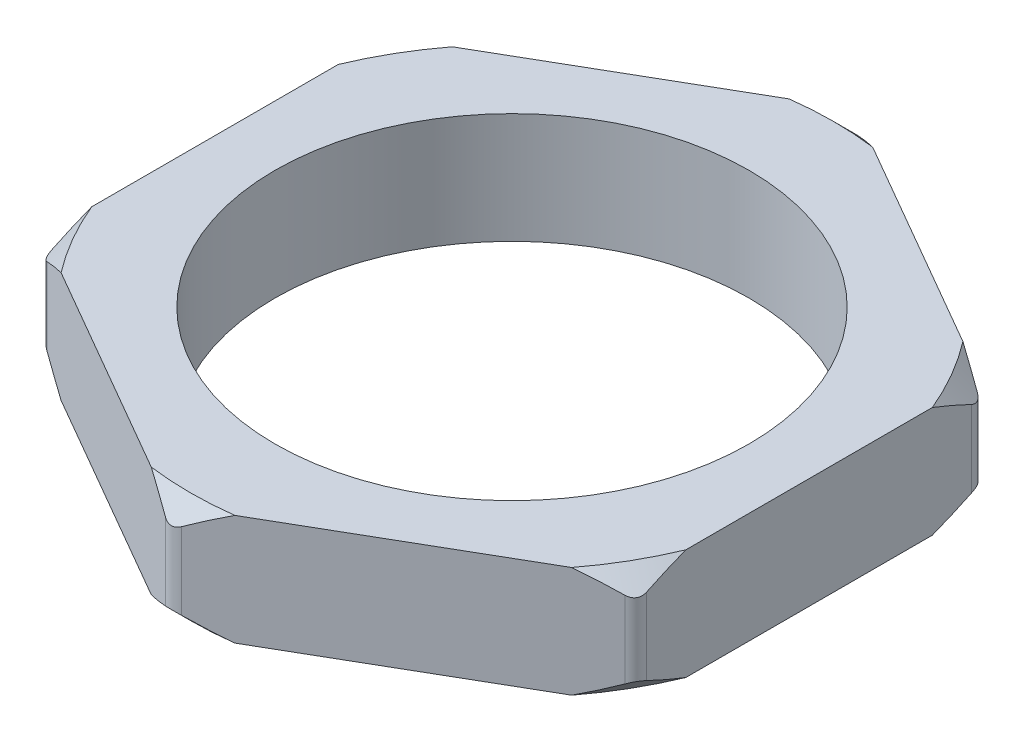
ISO-10303-21;
HEADER;
FILE_DESCRIPTION(('STEP AP214'),'2;1');
FILE_NAME('part.step','',(''),(''),'','','');
FILE_SCHEMA(('AUTOMOTIVE_DESIGN { 1 0 10303 214 1 1 1 1 }'));
ENDSEC;
DATA;
#1=APPLICATION_CONTEXT('core data for automotive mechanical design processes');
#2=APPLICATION_PROTOCOL_DEFINITION('international standard','automotive_design',2000,#1);
#3=PRODUCT_CONTEXT('',#1,'mechanical');
#4=PRODUCT('Part','Part','',(#3));
#5=PRODUCT_RELATED_PRODUCT_CATEGORY('part','',(#4));
#6=PRODUCT_DEFINITION_FORMATION('','',#4);
#7=PRODUCT_DEFINITION_CONTEXT('part definition',#1,'design');
#8=PRODUCT_DEFINITION('design','',#6,#7);
#9=PRODUCT_DEFINITION_SHAPE('','',#8);
#10=(LENGTH_UNIT() NAMED_UNIT(*) SI_UNIT(.MILLI.,.METRE.));
#11=(NAMED_UNIT(*) PLANE_ANGLE_UNIT() SI_UNIT($,.RADIAN.));
#12=(NAMED_UNIT(*) SI_UNIT($,.STERADIAN.) SOLID_ANGLE_UNIT());
#13=UNCERTAINTY_MEASURE_WITH_UNIT(LENGTH_MEASURE(1.E-05),#10,'distance_accuracy_value','');
#14=(GEOMETRIC_REPRESENTATION_CONTEXT(3) GLOBAL_UNCERTAINTY_ASSIGNED_CONTEXT((#13)) GLOBAL_UNIT_ASSIGNED_CONTEXT((#10,
#11,#12)) REPRESENTATION_CONTEXT('',''));
#15=CARTESIAN_POINT('',(0.,0.,0.));
#16=DIRECTION('',(0.,0.,1.));
#17=DIRECTION('',(1.,0.,0.));
#18=AXIS2_PLACEMENT_3D('',#15,#16,#17);
#19=CARTESIAN_POINT('',(0.,4.445,-13.7848150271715));
#20=DIRECTION('',(0.500000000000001,0.,0.866025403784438));
#21=DIRECTION('',(0.866025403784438,0.,-0.500000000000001));
#22=AXIS2_PLACEMENT_3D('',#19,#20,#21);
#23=PLANE('',#22);
#24=CARTESIAN_POINT('',(-19.4649832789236,6.70629507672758,-2.5467016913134));
#25=CARTESIAN_POINT('',(-19.1715932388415,6.4374022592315,-2.71609050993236));
#26=CARTESIAN_POINT('',(-18.8768611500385,6.17043885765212,-2.88625416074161));
#27=CARTESIAN_POINT('',(-18.2842066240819,5.6411793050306,-3.2284234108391));
#28=CARTESIAN_POINT('',(-17.9862837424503,5.37888381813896,-3.4004292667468));
#29=CARTESIAN_POINT('',(-17.3855668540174,4.85875645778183,-3.7472533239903));
#30=CARTESIAN_POINT('',(-17.0827576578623,4.60094791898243,-3.92208029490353));
#31=CARTESIAN_POINT('',(-16.4729280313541,4.09207590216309,-4.27416559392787));
#32=CARTESIAN_POINT('',(-16.165907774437,3.84101214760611,-4.45142382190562));
#33=CARTESIAN_POINT('',(-15.534257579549,3.33689971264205,-4.81610723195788));
#34=CARTESIAN_POINT('',(-15.2094222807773,3.08419300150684,-5.00365097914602));
#35=CARTESIAN_POINT('',(-14.5535221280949,2.589678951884,-5.38233510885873));
#36=CARTESIAN_POINT('',(-14.2224567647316,2.3478725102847,-5.57347578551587));
#37=CARTESIAN_POINT('',(-13.5536633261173,1.87828545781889,-5.95960385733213));
#38=CARTESIAN_POINT('',(-13.2159470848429,1.65048246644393,-6.15458442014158));
#39=CARTESIAN_POINT('',(-12.5322712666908,1.2120194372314,-6.54930483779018));
#40=CARTESIAN_POINT('',(-12.1863134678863,1.00135574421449,-6.74904366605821));
#41=CARTESIAN_POINT('',(-11.6754115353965,0.710210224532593,-7.04401303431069));
#42=CARTESIAN_POINT('',(-11.5141294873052,0.621126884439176,-7.13712926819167));
#43=CARTESIAN_POINT('',(-11.189549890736,0.448043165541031,-7.32452538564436));
#44=CARTESIAN_POINT('',(-11.0262525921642,0.364042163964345,-7.41880512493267));
#45=CARTESIAN_POINT('',(-10.6975506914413,0.201679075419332,-7.60858125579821));
#46=CARTESIAN_POINT('',(-10.5321459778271,0.123317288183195,-7.70407771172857));
#47=CARTESIAN_POINT('',(-10.1991546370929,-0.0271590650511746,-7.89633035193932));
#48=CARTESIAN_POINT('',(-10.0315672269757,-0.0992713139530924,-7.99308698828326));
#49=CARTESIAN_POINT('',(-9.52857756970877,-0.303982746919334,-8.28348820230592));
#50=CARTESIAN_POINT('',(-9.18999961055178,-0.426435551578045,-8.47896627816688));
#51=CARTESIAN_POINT('',(-8.50527430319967,-0.638489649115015,-8.87429261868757));
#52=CARTESIAN_POINT('',(-8.159130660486,-0.72810665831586,-9.07413874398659));
#53=CARTESIAN_POINT('',(-7.51080745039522,-0.859355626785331,-9.44844832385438));
#54=CARTESIAN_POINT('',(-7.2093955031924,-0.906007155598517,-9.6224685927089));
#55=CARTESIAN_POINT('',(-6.60421018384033,-0.969127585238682,-9.97187249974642));
#56=CARTESIAN_POINT('',(-6.30043714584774,-0.985600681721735,-10.147255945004));
#57=CARTESIAN_POINT('',(-5.69286222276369,-0.987474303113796,-10.4980394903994));
#58=CARTESIAN_POINT('',(-5.38906034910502,-0.972879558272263,-10.6734395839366));
#59=CARTESIAN_POINT('',(-4.78368893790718,-0.91343061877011,-11.0229509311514));
#60=CARTESIAN_POINT('',(-4.48211974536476,-0.868571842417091,-11.197061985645));
#61=CARTESIAN_POINT('',(-3.7922230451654,-0.732923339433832,-11.5953740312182));
#62=CARTESIAN_POINT('',(-3.40534057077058,-0.632326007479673,-11.8187407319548));
#63=CARTESIAN_POINT('',(-2.6412227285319,-0.390596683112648,-12.2599043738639));
#64=CARTESIAN_POINT('',(-2.26399238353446,-0.249444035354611,-12.4776984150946));
#65=CARTESIAN_POINT('',(-1.51613470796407,0.0673418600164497,-12.9094742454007));
#66=CARTESIAN_POINT('',(-1.14562067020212,0.243326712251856,-13.1233906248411));
#67=CARTESIAN_POINT('',(-0.41505195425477,0.621715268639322,-13.5451846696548));
#68=CARTESIAN_POINT('',(-0.0549955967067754,0.824114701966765,-13.7530633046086));
#69=CARTESIAN_POINT('',(0.630645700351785,1.23463312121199,-14.1489184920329));
#70=CARTESIAN_POINT('',(0.956870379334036,1.44134095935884,-14.3372643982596));
#71=CARTESIAN_POINT('',(1.60221011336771,1.86912543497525,-14.7098514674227));
#72=CARTESIAN_POINT('',(1.92132396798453,2.09020447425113,-14.8940919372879));
#73=CARTESIAN_POINT('',(2.55367929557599,2.544165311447,-15.2591824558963));
#74=CARTESIAN_POINT('',(2.86691347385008,2.77706059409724,-15.4400282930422));
#75=CARTESIAN_POINT('',(3.48795503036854,3.25222672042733,-15.7985868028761));
#76=CARTESIAN_POINT('',(3.79576275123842,3.4944969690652,-15.976299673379));
#77=CARTESIAN_POINT('',(4.39435878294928,3.97678140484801,-16.3218992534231));
#78=CARTESIAN_POINT('',(4.6853319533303,4.2164905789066,-16.4898926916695));
#79=CARTESIAN_POINT('',(5.26355705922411,4.70183276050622,-16.8237311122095));
#80=CARTESIAN_POINT('',(5.55080887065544,4.94746596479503,-16.9895760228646));
#81=CARTESIAN_POINT('',(6.12117256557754,5.44292398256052,-17.3188756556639));
#82=CARTESIAN_POINT('',(6.40429460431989,5.6927332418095,-17.4823362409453));
#83=CARTESIAN_POINT('',(6.96767743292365,6.19654331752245,-17.8076054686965));
#84=CARTESIAN_POINT('',(7.24793854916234,6.45054364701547,-17.9694142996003));
#85=CARTESIAN_POINT('',(7.52698327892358,6.70629507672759,-18.1305208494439));
#86=B_SPLINE_CURVE_WITH_KNOTS('',3,(#24,#25,#26,#27,#28,#29,#30,#31,#32,#33,#34,#35,#36,#37,#38,
#39,#40,#41,#42,#43,#44,#45,#46,#47,#48,#49,#50,#51,#52,#53,#54,#55,#56,#57,#58,#59,#60,#61,#62,
#63,#64,#65,#66,#67,#68,#69,#70,#71,#72,#73,#74,#75,#76,#77,#78,#79,#80,#81,#82,#83,#84,#85),
.UNSPECIFIED.,.F.,.F.,(4,2,2,2,2,2,2,2,2,2,2,2,2,2,2,2,2,2,2,2,2,2,2,2,2,2,2,2,2,2,4),(0.,
1.29757449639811,2.59533215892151,3.8985327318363,5.20167979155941,6.55834777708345,
7.915127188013,9.26967855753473,10.6239402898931,11.2432053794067,11.862394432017,
12.4816163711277,13.1010669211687,14.3288559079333,15.5560564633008,16.6082997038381,
17.6603966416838,18.7123334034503,19.7644294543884,21.1358144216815,22.5078990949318,
23.8946137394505,25.2811044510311,26.5697689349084,27.8586493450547,29.1490352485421,
30.4393393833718,31.6774605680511,32.9156229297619,34.1499037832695,35.3840422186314),.UNSPECIFIED.);
#87=CARTESIAN_POINT('',(-11.6205,0.680631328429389,-7.07571622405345));
#88=VERTEX_POINT('',#87);
#89=CARTESIAN_POINT('',(-10.2581370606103,0.,-7.8622768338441));
#90=VERTEX_POINT('',#89);
#91=EDGE_CURVE('E380',#88,#90,#86,.T.);
#92=ORIENTED_EDGE('',*,*,#91,.F.);
#93=DIRECTION('',(0.,-1.,0.));
#94=VECTOR('',#93,1.);
#95=CARTESIAN_POINT('',(-11.6205,4.445,-7.07571622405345));
#96=LINE('',#95,#94);
#97=CARTESIAN_POINT('',(-11.6205,3.76436867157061,-7.07571622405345));
#98=VERTEX_POINT('',#97);
#99=EDGE_CURVE('E255',#88,#98,#96,.F.);
#100=ORIENTED_EDGE('',*,*,#99,.T.);
#101=CARTESIAN_POINT('',(7.52698327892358,-2.26129507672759,-18.1305208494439));
#102=CARTESIAN_POINT('',(7.23359323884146,-1.99240225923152,-17.9611320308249));
#103=CARTESIAN_POINT('',(6.93886115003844,-1.72543885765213,-17.7909683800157));
#104=CARTESIAN_POINT('',(6.34620662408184,-1.19617930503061,-17.4487991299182));
#105=CARTESIAN_POINT('',(6.04828374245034,-0.933883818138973,-17.2767932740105));
#106=CARTESIAN_POINT('',(5.44756685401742,-0.413756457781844,-16.929969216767));
#107=CARTESIAN_POINT('',(5.14475765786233,-0.155947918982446,-16.7551422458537));
#108=CARTESIAN_POINT('',(4.5349280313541,0.352924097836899,-16.4030569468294));
#109=CARTESIAN_POINT('',(4.22790777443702,0.603987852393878,-16.2257987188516));
#110=CARTESIAN_POINT('',(3.59625757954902,1.10810028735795,-15.8611153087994));
#111=CARTESIAN_POINT('',(3.27142228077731,1.36080699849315,-15.6735715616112));
#112=CARTESIAN_POINT('',(2.61552212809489,1.85532104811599,-15.2948874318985));
#113=CARTESIAN_POINT('',(2.28445676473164,2.0971274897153,-15.1037467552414));
#114=CARTESIAN_POINT('',(1.61566332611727,2.5667145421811,-14.7176186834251));
#115=CARTESIAN_POINT('',(1.27794708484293,2.79451753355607,-14.5226381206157));
#116=CARTESIAN_POINT('',(0.594271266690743,3.23298056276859,-14.1279177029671));
#117=CARTESIAN_POINT('',(0.24831346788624,3.44364425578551,-13.928178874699));
#118=CARTESIAN_POINT('',(-0.262588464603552,3.7347897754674,-13.6332095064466));
#119=CARTESIAN_POINT('',(-0.423870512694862,3.82387311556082,-13.5400932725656));
#120=CARTESIAN_POINT('',(-0.748450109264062,3.99695683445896,-13.3526971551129));
#121=CARTESIAN_POINT('',(-0.911747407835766,4.08095783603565,-13.2584174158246));
#122=CARTESIAN_POINT('',(-1.24044930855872,4.24332092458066,-13.0686412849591));
#123=CARTESIAN_POINT('',(-1.40585402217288,4.3216827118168,-12.9731448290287));
#124=CARTESIAN_POINT('',(-1.73884536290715,4.47215906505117,-12.7808921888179));
#125=CARTESIAN_POINT('',(-1.90643277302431,4.54427131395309,-12.684135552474));
#126=CARTESIAN_POINT('',(-2.40942243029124,4.74898274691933,-12.3937343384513));
#127=CARTESIAN_POINT('',(-2.74800038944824,4.87143555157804,-12.1982562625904));
#128=CARTESIAN_POINT('',(-3.43272569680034,5.08348964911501,-11.8029299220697));
#129=CARTESIAN_POINT('',(-3.77886933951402,5.17310665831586,-11.6030837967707));
#130=CARTESIAN_POINT('',(-4.42719254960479,5.30435562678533,-11.2287742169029));
#131=CARTESIAN_POINT('',(-4.72860449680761,5.35100715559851,-11.0547539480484));
#132=CARTESIAN_POINT('',(-5.33378981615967,5.41412758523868,-10.7053500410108));
#133=CARTESIAN_POINT('',(-5.63756285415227,5.43060068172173,-10.5299665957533));
#134=CARTESIAN_POINT('',(-6.24513777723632,5.43247430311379,-10.1791830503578));
#135=CARTESIAN_POINT('',(-6.54893965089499,5.41787955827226,-10.0037829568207));
#136=CARTESIAN_POINT('',(-7.15431106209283,5.35843061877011,-9.65427160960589));
#137=CARTESIAN_POINT('',(-7.45588025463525,5.31357184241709,-9.48016055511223));
#138=CARTESIAN_POINT('',(-8.14577695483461,5.17792333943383,-9.08184850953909));
#139=CARTESIAN_POINT('',(-8.53265942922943,5.07732600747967,-8.8584818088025));
#140=CARTESIAN_POINT('',(-9.29677727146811,4.83559668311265,-8.4173181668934));
#141=CARTESIAN_POINT('',(-9.67400761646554,4.69444403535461,-8.19952412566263));
#142=CARTESIAN_POINT('',(-10.4218652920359,4.37765813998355,-7.76774829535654));
#143=CARTESIAN_POINT('',(-10.7923793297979,4.20167328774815,-7.55383191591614));
#144=CARTESIAN_POINT('',(-11.5229480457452,3.82328473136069,-7.13203787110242));
#145=CARTESIAN_POINT('',(-11.8830044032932,3.62088529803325,-6.92415923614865));
#146=CARTESIAN_POINT('',(-12.5686457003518,3.21036687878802,-6.52830404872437));
#147=CARTESIAN_POINT('',(-12.894870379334,3.00365904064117,-6.33995814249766));
#148=CARTESIAN_POINT('',(-13.5402101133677,2.57587456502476,-5.96737107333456));
#149=CARTESIAN_POINT('',(-13.8593239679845,2.35479552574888,-5.7831306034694));
#150=CARTESIAN_POINT('',(-14.491679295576,1.90083468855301,-5.41804008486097));
#151=CARTESIAN_POINT('',(-14.8049134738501,1.66793940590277,-5.23719424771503));
#152=CARTESIAN_POINT('',(-15.4259550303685,1.19277327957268,-4.87863573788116));
#153=CARTESIAN_POINT('',(-15.7337627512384,0.950503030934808,-4.70092286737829));
#154=CARTESIAN_POINT('',(-16.3323587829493,0.468218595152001,-4.35532328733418));
#155=CARTESIAN_POINT('',(-16.6233319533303,0.228509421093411,-4.18732984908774));
#156=CARTESIAN_POINT('',(-17.2015570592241,-0.256832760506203,-3.85349142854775));
#157=CARTESIAN_POINT('',(-17.4888088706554,-0.502465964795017,-3.68764651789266));
#158=CARTESIAN_POINT('',(-18.0591725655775,-0.99792398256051,-3.3583468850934));
#159=CARTESIAN_POINT('',(-18.3422946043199,-1.24773324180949,-3.19488629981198));
#160=CARTESIAN_POINT('',(-18.9056774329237,-1.75154331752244,-2.86961707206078));
#161=CARTESIAN_POINT('',(-19.1859385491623,-2.00554364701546,-2.70780824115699));
#162=CARTESIAN_POINT('',(-19.4649832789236,-2.26129507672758,-2.54670169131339));
#163=B_SPLINE_CURVE_WITH_KNOTS('',3,(#101,#102,#103,#104,#105,#106,#107,#108,#109,#110,#111,
#112,#113,#114,#115,#116,#117,#118,#119,#120,#121,#122,#123,#124,#125,#126,#127,#128,#129,#130,
#131,#132,#133,#134,#135,#136,#137,#138,#139,#140,#141,#142,#143,#144,#145,#146,#147,#148,#149,
#150,#151,#152,#153,#154,#155,#156,#157,#158,#159,#160,#161,#162),.UNSPECIFIED.,.F.,.F.,(4,2,2,
2,2,2,2,2,2,2,2,2,2,2,2,2,2,2,2,2,2,2,2,2,2,2,2,2,2,2,4),(0.,1.29757449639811,2.59533215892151,
3.8985327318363,5.20167979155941,6.55834777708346,7.91512718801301,9.26967855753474,
10.6239402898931,11.2432053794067,11.862394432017,12.4816163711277,13.1010669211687,
14.3288559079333,15.5560564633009,16.6082997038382,17.6603966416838,18.7123334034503,
19.7644294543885,21.1358144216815,22.5078990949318,23.8946137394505,25.2811044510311,
26.5697689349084,27.8586493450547,29.1490352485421,30.4393393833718,31.6774605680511,
32.9156229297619,34.1499037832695,35.3840422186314),.UNSPECIFIED.);
#164=CARTESIAN_POINT('',(-10.2581370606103,4.445,-7.8622768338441));
#165=VERTEX_POINT('',#164);
#166=EDGE_CURVE('E357',#165,#98,#163,.T.);
#167=ORIENTED_EDGE('',*,*,#166,.F.);
#168=DIRECTION('',(-0.866025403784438,0.,0.500000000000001));
#169=VECTOR('',#168,1.);
#170=CARTESIAN_POINT('',(0.,4.445,-13.7848150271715));
#171=LINE('',#170,#169);
#172=CARTESIAN_POINT('',(-1.67986293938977,4.445,-12.8149457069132));
#173=VERTEX_POINT('',#172);
#174=EDGE_CURVE('E224',#173,#165,#171,.T.);
#175=ORIENTED_EDGE('',*,*,#174,.F.);
#176=CARTESIAN_POINT('',(-0.3175,3.7643686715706,-13.6015063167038));
#177=VERTEX_POINT('',#176);
#178=EDGE_CURVE('E342',#177,#173,#163,.T.);
#179=ORIENTED_EDGE('',*,*,#178,.F.);
#180=DIRECTION('',(0.,-1.,0.));
#181=VECTOR('',#180,1.);
#182=CARTESIAN_POINT('',(-0.317500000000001,4.445,-13.6015063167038));
#183=LINE('',#182,#181);
#184=CARTESIAN_POINT('',(-0.3175,0.680631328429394,-13.6015063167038));
#185=VERTEX_POINT('',#184);
#186=EDGE_CURVE('E252',#177,#185,#183,.T.);
#187=ORIENTED_EDGE('',*,*,#186,.T.);
#188=CARTESIAN_POINT('',(-1.67986293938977,0.,-12.8149457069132));
#189=VERTEX_POINT('',#188);
#190=EDGE_CURVE('E436',#189,#185,#86,.T.);
#191=ORIENTED_EDGE('',*,*,#190,.F.);
#192=DIRECTION('',(-0.866025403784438,0.,0.500000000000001));
#193=VECTOR('',#192,1.);
#194=CARTESIAN_POINT('',(0.,0.,-13.7848150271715));
#195=LINE('',#194,#193);
#196=EDGE_CURVE('E497',#189,#90,#195,.T.);
#197=ORIENTED_EDGE('',*,*,#196,.T.);
#198=EDGE_LOOP('',(#92,#100,#167,#175,#179,#187,#191,#197));
#199=FACE_BOUND('',#198,.T.);
#200=ADVANCED_FACE('F28',(#199),#23,.F.);
#201=CARTESIAN_POINT('',(-11.938,4.445,-6.89240751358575));
#202=DIRECTION('',(1.,0.,0.));
#203=DIRECTION('',(0.,0.,-1.));
#204=AXIS2_PLACEMENT_3D('',#201,#202,#203);
#205=PLANE('',#204);
#206=CARTESIAN_POINT('',(-11.938,5.75751286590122,14.3702733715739));
#207=CARTESIAN_POINT('',(-11.938,5.4876450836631,14.0193498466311));
#208=CARTESIAN_POINT('',(-11.938,5.22022301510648,13.6665146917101));
#209=CARTESIAN_POINT('',(-11.938,4.69140302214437,12.9562287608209));
#210=CARTESIAN_POINT('',(-11.938,4.43000659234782,12.5987768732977));
#211=CARTESIAN_POINT('',(-11.938,3.91240825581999,11.8757086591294));
#212=CARTESIAN_POINT('',(-11.938,3.6562658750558,11.5100495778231));
#213=CARTESIAN_POINT('',(-11.938,3.15307266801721,10.7725484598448));
#214=CARTESIAN_POINT('',(-11.938,2.90602120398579,10.4007068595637));
#215=CARTESIAN_POINT('',(-11.938,2.40693262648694,9.62463620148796));
#216=CARTESIAN_POINT('',(-11.938,2.15567029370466,9.21990626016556));
#217=CARTESIAN_POINT('',(-11.938,1.66923628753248,8.40073145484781));
#218=CARTESIAN_POINT('',(-11.938,1.43406744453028,7.98628489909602));
#219=CARTESIAN_POINT('',(-11.938,0.985075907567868,7.14757186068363));
#220=CARTESIAN_POINT('',(-11.938,0.771188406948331,6.72334036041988));
#221=CARTESIAN_POINT('',(-11.938,0.369844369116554,5.86264987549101));
#222=CARTESIAN_POINT('',(-11.938,0.182374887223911,5.42619700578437));
#223=CARTESIAN_POINT('',(-11.938,-0.151792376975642,4.55869216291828));
#224=CARTESIAN_POINT('',(-11.938,-0.299866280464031,4.12817630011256));
#225=CARTESIAN_POINT('',(-11.938,-0.557651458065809,3.25551014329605));
#226=CARTESIAN_POINT('',(-11.938,-0.667364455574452,2.81336037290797));
#227=CARTESIAN_POINT('',(-11.938,-0.796692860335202,2.14845483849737));
#228=CARTESIAN_POINT('',(-11.938,-0.833703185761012,1.92900724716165));
#229=CARTESIAN_POINT('',(-11.938,-0.89611637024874,1.48848091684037));
#230=CARTESIAN_POINT('',(-11.938,-0.921521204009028,1.26740246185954));
#231=CARTESIAN_POINT('',(-11.938,-0.960199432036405,0.824197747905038));
#232=CARTESIAN_POINT('',(-11.938,-0.973473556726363,0.602071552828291));
#233=CARTESIAN_POINT('',(-11.938,-0.98761018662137,0.157421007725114));
#234=CARTESIAN_POINT('',(-11.938,-0.988472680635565,-0.0651033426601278));
#235=CARTESIAN_POINT('',(-11.938,-0.977745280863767,-0.510711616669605));
#236=CARTESIAN_POINT('',(-11.938,-0.966107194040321,-0.733794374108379));
#237=CARTESIAN_POINT('',(-11.938,-0.930557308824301,-1.17897385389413));
#238=CARTESIAN_POINT('',(-11.938,-0.90664545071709,-1.4010705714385));
#239=CARTESIAN_POINT('',(-11.938,-0.847040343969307,-1.84369737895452));
#240=CARTESIAN_POINT('',(-11.938,-0.811345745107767,-2.06422728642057));
#241=CARTESIAN_POINT('',(-11.938,-0.728867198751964,-2.50321718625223));
#242=CARTESIAN_POINT('',(-11.938,-0.68208139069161,-2.721676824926));
#243=CARTESIAN_POINT('',(-11.938,-0.523981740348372,-3.38300874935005));
#244=CARTESIAN_POINT('',(-11.938,-0.396298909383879,-3.82202767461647));
#245=CARTESIAN_POINT('',(-11.938,-0.105621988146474,-4.68791786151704));
#246=CARTESIAN_POINT('',(-11.938,0.0573727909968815,-5.11478888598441));
#247=CARTESIAN_POINT('',(-11.938,0.408511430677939,-5.94948865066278));
#248=CARTESIAN_POINT('',(-11.938,0.596186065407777,-6.35751693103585));
#249=CARTESIAN_POINT('',(-11.938,0.993098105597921,-7.16301792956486));
#250=CARTESIAN_POINT('',(-11.938,1.20234300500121,-7.56048691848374));
#251=CARTESIAN_POINT('',(-11.938,1.63832389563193,-8.34683256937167));
#252=CARTESIAN_POINT('',(-11.938,1.86509869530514,-8.7356875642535));
#253=CARTESIAN_POINT('',(-11.938,2.3321820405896,-9.50507029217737));
#254=CARTESIAN_POINT('',(-11.938,2.57248886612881,-9.88559907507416));
#255=CARTESIAN_POINT('',(-11.938,3.04885160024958,-10.6163365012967));
#256=CARTESIAN_POINT('',(-11.938,3.28425892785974,-10.9669698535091));
#257=CARTESIAN_POINT('',(-11.938,3.76295251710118,-11.6628313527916));
#258=CARTESIAN_POINT('',(-11.938,4.00623921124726,-12.0080592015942));
#259=CARTESIAN_POINT('',(-11.938,4.49783626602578,-12.6917674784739));
#260=CARTESIAN_POINT('',(-11.938,4.74610771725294,-13.0302759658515));
#261=CARTESIAN_POINT('',(-11.938,5.24802202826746,-13.7031875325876));
#262=CARTESIAN_POINT('',(-11.938,5.50166382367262,-14.0375914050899));
#263=CARTESIAN_POINT('',(-11.938,5.75751286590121,-14.3702733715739));
#264=B_SPLINE_CURVE_WITH_KNOTS('',3,(#206,#207,#208,#209,#210,#211,#212,#213,#214,#215,#216,
#217,#218,#219,#220,#221,#222,#223,#224,#225,#226,#227,#228,#229,#230,#231,#232,#233,#234,#235,
#236,#237,#238,#239,#240,#241,#242,#243,#244,#245,#246,#247,#248,#249,#250,#251,#252,#253,#254,
#255,#256,#257,#258,#259,#260,#261,#262,#263),.UNSPECIFIED.,.F.,.F.,(4,2,2,2,2,2,2,2,2,2,2,2,2,
2,2,2,2,2,2,2,2,2,2,2,2,2,2,2,4),(0.,1.32810053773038,2.65652703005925,3.99575602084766,
5.33489088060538,6.76373849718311,8.19283676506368,9.61744058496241,11.0413439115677,
12.4057610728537,13.770116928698,14.4374987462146,15.1047669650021,15.7719950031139,
16.4392236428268,17.1090338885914,17.7788473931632,18.4487376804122,19.1187404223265,
20.488321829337,21.8579299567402,23.2044965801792,24.5515326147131,25.90164123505,
27.2515786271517,28.5184355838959,29.7853621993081,31.0446858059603,32.3037621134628),.UNSPECIFIED.);
#265=CARTESIAN_POINT('',(-11.938,0.680631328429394,6.52579009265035));
#266=VERTEX_POINT('',#265);
#267=CARTESIAN_POINT('',(-11.938,0.,4.95266887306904));
#268=VERTEX_POINT('',#267);
#269=EDGE_CURVE('E382',#266,#268,#264,.T.);
#270=ORIENTED_EDGE('',*,*,#269,.F.);
#271=DIRECTION('',(0.,-1.,0.));
#272=VECTOR('',#271,1.);
#273=CARTESIAN_POINT('',(-11.938,4.445,6.52579009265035));
#274=LINE('',#273,#272);
#275=CARTESIAN_POINT('',(-11.938,3.76436867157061,6.52579009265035));
#276=VERTEX_POINT('',#275);
#277=EDGE_CURVE('E250',#266,#276,#274,.F.);
#278=ORIENTED_EDGE('',*,*,#277,.T.);
#279=CARTESIAN_POINT('',(-11.938,-1.31251286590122,-14.3702733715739));
#280=CARTESIAN_POINT('',(-11.938,-1.0426450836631,-14.0193498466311));
#281=CARTESIAN_POINT('',(-11.938,-0.775223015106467,-13.6665146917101));
#282=CARTESIAN_POINT('',(-11.938,-0.246403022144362,-12.9562287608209));
#283=CARTESIAN_POINT('',(-11.938,0.0149934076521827,-12.5987768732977));
#284=CARTESIAN_POINT('',(-11.938,0.532591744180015,-11.8757086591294));
#285=CARTESIAN_POINT('',(-11.938,0.788734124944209,-11.5100495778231));
#286=CARTESIAN_POINT('',(-11.938,1.29192733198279,-10.7725484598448));
#287=CARTESIAN_POINT('',(-11.938,1.53897879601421,-10.4007068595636));
#288=CARTESIAN_POINT('',(-11.938,2.03806737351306,-9.62463620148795));
#289=CARTESIAN_POINT('',(-11.938,2.28932970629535,-9.21990626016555));
#290=CARTESIAN_POINT('',(-11.938,2.77576371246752,-8.4007314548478));
#291=CARTESIAN_POINT('',(-11.938,3.01093255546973,-7.98628489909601));
#292=CARTESIAN_POINT('',(-11.938,3.45992409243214,-7.14757186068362));
#293=CARTESIAN_POINT('',(-11.938,3.67381159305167,-6.72334036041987));
#294=CARTESIAN_POINT('',(-11.938,4.07515563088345,-5.862649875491));
#295=CARTESIAN_POINT('',(-11.938,4.26262511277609,-5.42619700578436));
#296=CARTESIAN_POINT('',(-11.938,4.59679237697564,-4.55869216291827));
#297=CARTESIAN_POINT('',(-11.938,4.74486628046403,-4.12817630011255));
#298=CARTESIAN_POINT('',(-11.938,5.00265145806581,-3.25551014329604));
#299=CARTESIAN_POINT('',(-11.938,5.11236445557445,-2.81336037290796));
#300=CARTESIAN_POINT('',(-11.938,5.2416928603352,-2.14845483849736));
#301=CARTESIAN_POINT('',(-11.938,5.27870318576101,-1.92900724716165));
#302=CARTESIAN_POINT('',(-11.938,5.34111637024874,-1.48848091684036));
#303=CARTESIAN_POINT('',(-11.938,5.36652120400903,-1.26740246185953));
#304=CARTESIAN_POINT('',(-11.938,5.40519943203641,-0.82419774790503));
#305=CARTESIAN_POINT('',(-11.938,5.41847355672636,-0.602071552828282));
#306=CARTESIAN_POINT('',(-11.938,5.43261018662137,-0.157421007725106));
#307=CARTESIAN_POINT('',(-11.938,5.43347268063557,0.0651033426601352));
#308=CARTESIAN_POINT('',(-11.938,5.42274528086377,0.510711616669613));
#309=CARTESIAN_POINT('',(-11.938,5.41110719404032,0.733794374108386));
#310=CARTESIAN_POINT('',(-11.938,5.3755573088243,1.17897385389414));
#311=CARTESIAN_POINT('',(-11.938,5.35164545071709,1.40107057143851));
#312=CARTESIAN_POINT('',(-11.938,5.29204034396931,1.84369737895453));
#313=CARTESIAN_POINT('',(-11.938,5.25634574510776,2.06422728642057));
#314=CARTESIAN_POINT('',(-11.938,5.17386719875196,2.50321718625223));
#315=CARTESIAN_POINT('',(-11.938,5.12708139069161,2.721676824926));
#316=CARTESIAN_POINT('',(-11.938,4.96898174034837,3.38300874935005));
#317=CARTESIAN_POINT('',(-11.938,4.84129890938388,3.82202767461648));
#318=CARTESIAN_POINT('',(-11.938,4.55062198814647,4.68791786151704));
#319=CARTESIAN_POINT('',(-11.938,4.38762720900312,5.11478888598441));
#320=CARTESIAN_POINT('',(-11.938,4.03648856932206,5.94948865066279));
#321=CARTESIAN_POINT('',(-11.938,3.84881393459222,6.35751693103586));
#322=CARTESIAN_POINT('',(-11.938,3.45190189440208,7.16301792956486));
#323=CARTESIAN_POINT('',(-11.938,3.24265699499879,7.56048691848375));
#324=CARTESIAN_POINT('',(-11.938,2.80667610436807,8.34683256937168));
#325=CARTESIAN_POINT('',(-11.938,2.57990130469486,8.7356875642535));
#326=CARTESIAN_POINT('',(-11.938,2.1128179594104,9.50507029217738));
#327=CARTESIAN_POINT('',(-11.938,1.87251113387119,9.88559907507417));
#328=CARTESIAN_POINT('',(-11.938,1.39614839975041,10.6163365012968));
#329=CARTESIAN_POINT('',(-11.938,1.16074107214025,10.9669698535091));
#330=CARTESIAN_POINT('',(-11.938,0.682047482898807,11.6628313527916));
#331=CARTESIAN_POINT('',(-11.938,0.438760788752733,12.0080592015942));
#332=CARTESIAN_POINT('',(-11.938,-0.0528362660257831,12.6917674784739));
#333=CARTESIAN_POINT('',(-11.938,-0.301107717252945,13.0302759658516));
#334=CARTESIAN_POINT('',(-11.938,-0.80302202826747,13.7031875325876));
#335=CARTESIAN_POINT('',(-11.938,-1.05666382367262,14.0375914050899));
#336=CARTESIAN_POINT('',(-11.938,-1.31251286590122,14.3702733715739));
#337=B_SPLINE_CURVE_WITH_KNOTS('',3,(#279,#280,#281,#282,#283,#284,#285,#286,#287,#288,#289,
#290,#291,#292,#293,#294,#295,#296,#297,#298,#299,#300,#301,#302,#303,#304,#305,#306,#307,#308,
#309,#310,#311,#312,#313,#314,#315,#316,#317,#318,#319,#320,#321,#322,#323,#324,#325,#326,#327,
#328,#329,#330,#331,#332,#333,#334,#335,#336),.UNSPECIFIED.,.F.,.F.,(4,2,2,2,2,2,2,2,2,2,2,2,2,
2,2,2,2,2,2,2,2,2,2,2,2,2,2,2,4),(0.,1.32810053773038,2.65652703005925,3.99575602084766,
5.33489088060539,6.76373849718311,8.19283676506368,9.61744058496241,11.0413439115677,
12.4057610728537,13.770116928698,14.4374987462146,15.1047669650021,15.7719950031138,
16.4392236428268,17.1090338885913,17.7788473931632,18.4487376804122,19.1187404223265,
20.488321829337,21.8579299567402,23.2044965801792,24.5515326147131,25.90164123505,
27.2515786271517,28.5184355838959,29.7853621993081,31.0446858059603,32.3037621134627),.UNSPECIFIED.);
#338=CARTESIAN_POINT('',(-11.938,4.445,4.95266887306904));
#339=VERTEX_POINT('',#338);
#340=EDGE_CURVE('E358',#339,#276,#337,.T.);
#341=ORIENTED_EDGE('',*,*,#340,.F.);
#342=DIRECTION('',(0.,0.,1.));
#343=VECTOR('',#342,1.);
#344=CARTESIAN_POINT('',(-11.938,4.445,-6.89240751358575));
#345=LINE('',#344,#343);
#346=CARTESIAN_POINT('',(-11.938,4.445,-4.95266887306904));
#347=VERTEX_POINT('',#346);
#348=EDGE_CURVE('E227',#347,#339,#345,.T.);
#349=ORIENTED_EDGE('',*,*,#348,.F.);
#350=CARTESIAN_POINT('',(-11.938,3.76436867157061,-6.52579009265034));
#351=VERTEX_POINT('',#350);
#352=EDGE_CURVE('E353',#351,#347,#337,.T.);
#353=ORIENTED_EDGE('',*,*,#352,.F.);
#354=DIRECTION('',(0.,-1.,0.));
#355=VECTOR('',#354,1.);
#356=CARTESIAN_POINT('',(-11.938,4.445,-6.52579009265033));
#357=LINE('',#356,#355);
#358=CARTESIAN_POINT('',(-11.938,0.680631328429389,-6.52579009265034));
#359=VERTEX_POINT('',#358);
#360=EDGE_CURVE('E247',#351,#359,#357,.T.);
#361=ORIENTED_EDGE('',*,*,#360,.T.);
#362=CARTESIAN_POINT('',(-11.938,0.,-4.95266887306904));
#363=VERTEX_POINT('',#362);
#364=EDGE_CURVE('E373',#363,#359,#264,.T.);
#365=ORIENTED_EDGE('',*,*,#364,.F.);
#366=DIRECTION('',(0.,0.,1.));
#367=VECTOR('',#366,1.);
#368=CARTESIAN_POINT('',(-11.938,0.,-6.89240751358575));
#369=LINE('',#368,#367);
#370=EDGE_CURVE('E218',#363,#268,#369,.T.);
#371=ORIENTED_EDGE('',*,*,#370,.T.);
#372=EDGE_LOOP('',(#270,#278,#341,#349,#353,#361,#365,#371));
#373=FACE_BOUND('',#372,.T.);
#374=ADVANCED_FACE('F365',(#373),#205,.F.);
#375=CARTESIAN_POINT('',(-11.938,4.445,6.89240751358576));
#376=DIRECTION('',(0.5,0.,-0.866025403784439));
#377=DIRECTION('',(-0.866025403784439,0.,-0.5));
#378=AXIS2_PLACEMENT_3D('',#375,#376,#377);
#379=PLANE('',#378);
#380=CARTESIAN_POINT('',(7.52698327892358,6.70629507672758,18.1305208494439));
#381=CARTESIAN_POINT('',(7.23359323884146,6.4374022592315,17.9611320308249));
#382=CARTESIAN_POINT('',(6.93886115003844,6.17043885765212,17.7909683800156));
#383=CARTESIAN_POINT('',(6.34620662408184,5.6411793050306,17.4487991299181));
#384=CARTESIAN_POINT('',(6.04828374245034,5.37888381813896,17.2767932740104));
#385=CARTESIAN_POINT('',(5.44756685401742,4.85875645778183,16.9299692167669));
#386=CARTESIAN_POINT('',(5.14475765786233,4.60094791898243,16.7551422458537));
#387=CARTESIAN_POINT('',(4.53492803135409,4.09207590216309,16.4030569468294));
#388=CARTESIAN_POINT('',(4.22790777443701,3.84101214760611,16.2257987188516));
#389=CARTESIAN_POINT('',(3.59625757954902,3.33689971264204,15.8611153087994));
#390=CARTESIAN_POINT('',(3.27142228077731,3.08419300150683,15.6735715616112));
#391=CARTESIAN_POINT('',(2.61552212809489,2.58967895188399,15.2948874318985));
#392=CARTESIAN_POINT('',(2.28445676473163,2.34787251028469,15.1037467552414));
#393=CARTESIAN_POINT('',(1.61566332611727,1.87828545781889,14.7176186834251));
#394=CARTESIAN_POINT('',(1.27794708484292,1.65048246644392,14.5226381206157));
#395=CARTESIAN_POINT('',(0.594271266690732,1.2120194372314,14.1279177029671));
#396=CARTESIAN_POINT('',(0.248313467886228,1.00135574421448,13.928178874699));
#397=CARTESIAN_POINT('',(-0.262588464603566,0.710210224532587,13.6332095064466));
#398=CARTESIAN_POINT('',(-0.423870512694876,0.62112688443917,13.5400932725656));
#399=CARTESIAN_POINT('',(-0.748450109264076,0.448043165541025,13.3526971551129));
#400=CARTESIAN_POINT('',(-0.91174740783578,0.364042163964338,13.2584174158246));
#401=CARTESIAN_POINT('',(-1.24044930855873,0.201679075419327,13.068641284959));
#402=CARTESIAN_POINT('',(-1.40585402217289,0.12331728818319,12.9731448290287));
#403=CARTESIAN_POINT('',(-1.73884536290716,-0.027159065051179,12.7808921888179));
#404=CARTESIAN_POINT('',(-1.90643277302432,-0.0992713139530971,12.684135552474));
#405=CARTESIAN_POINT('',(-2.40942243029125,-0.303982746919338,12.3937343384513));
#406=CARTESIAN_POINT('',(-2.74800038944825,-0.426435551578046,12.1982562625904));
#407=CARTESIAN_POINT('',(-3.43272569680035,-0.638489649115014,11.8029299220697));
#408=CARTESIAN_POINT('',(-3.77886933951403,-0.728106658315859,11.6030837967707));
#409=CARTESIAN_POINT('',(-4.42719254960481,-0.85935562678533,11.2287742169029));
#410=CARTESIAN_POINT('',(-4.72860449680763,-0.906007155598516,11.0547539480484));
#411=CARTESIAN_POINT('',(-5.3337898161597,-0.969127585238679,10.7053500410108));
#412=CARTESIAN_POINT('',(-5.63756285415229,-0.98560068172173,10.5299665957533));
#413=CARTESIAN_POINT('',(-6.24513777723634,-0.98747430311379,10.1791830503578));
#414=CARTESIAN_POINT('',(-6.54893965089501,-0.972879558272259,10.0037829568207));
#415=CARTESIAN_POINT('',(-7.15431106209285,-0.913430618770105,9.65427160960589));
#416=CARTESIAN_POINT('',(-7.45588025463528,-0.868571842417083,9.48016055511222));
#417=CARTESIAN_POINT('',(-8.14577695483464,-0.732923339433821,9.08184850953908));
#418=CARTESIAN_POINT('',(-8.53265942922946,-0.632326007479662,8.85848180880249));
#419=CARTESIAN_POINT('',(-9.29677727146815,-0.390596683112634,8.41731816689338));
#420=CARTESIAN_POINT('',(-9.67400761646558,-0.249444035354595,8.19952412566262));
#421=CARTESIAN_POINT('',(-10.421865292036,0.0673418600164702,7.76774829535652));
#422=CARTESIAN_POINT('',(-10.7923793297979,0.243326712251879,7.55383191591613));
#423=CARTESIAN_POINT('',(-11.5229480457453,0.621715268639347,7.1320378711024));
#424=CARTESIAN_POINT('',(-11.8830044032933,0.82411470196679,6.92415923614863));
#425=CARTESIAN_POINT('',(-12.5686457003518,1.23463312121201,6.52830404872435));
#426=CARTESIAN_POINT('',(-12.8948703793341,1.44134095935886,6.33995814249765));
#427=CARTESIAN_POINT('',(-13.5402101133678,1.86912543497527,5.96737107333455));
#428=CARTESIAN_POINT('',(-13.8593239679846,2.09020447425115,5.78313060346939));
#429=CARTESIAN_POINT('',(-14.491679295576,2.54416531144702,5.41804008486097));
#430=CARTESIAN_POINT('',(-14.8049134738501,2.77706059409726,5.23719424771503));
#431=CARTESIAN_POINT('',(-15.4259550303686,3.25222672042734,4.87863573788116));
#432=CARTESIAN_POINT('',(-15.7337627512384,3.49449696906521,4.70092286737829));
#433=CARTESIAN_POINT('',(-16.3323587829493,3.97678140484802,4.35532328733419));
#434=CARTESIAN_POINT('',(-16.6233319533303,4.2164905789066,4.18732984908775));
#435=CARTESIAN_POINT('',(-17.2015570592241,4.70183276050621,3.85349142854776));
#436=CARTESIAN_POINT('',(-17.4888088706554,4.94746596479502,3.68764651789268));
#437=CARTESIAN_POINT('',(-18.0591725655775,5.44292398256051,3.35834688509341));
#438=CARTESIAN_POINT('',(-18.3422946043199,5.69273324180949,3.194886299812));
#439=CARTESIAN_POINT('',(-18.9056774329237,6.19654331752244,2.86961707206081));
#440=CARTESIAN_POINT('',(-19.1859385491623,6.45054364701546,2.70780824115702));
#441=CARTESIAN_POINT('',(-19.4649832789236,6.70629507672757,2.54670169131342));
#442=B_SPLINE_CURVE_WITH_KNOTS('',3,(#380,#381,#382,#383,#384,#385,#386,#387,#388,#389,#390,
#391,#392,#393,#394,#395,#396,#397,#398,#399,#400,#401,#402,#403,#404,#405,#406,#407,#408,#409,
#410,#411,#412,#413,#414,#415,#416,#417,#418,#419,#420,#421,#422,#423,#424,#425,#426,#427,#428,
#429,#430,#431,#432,#433,#434,#435,#436,#437,#438,#439,#440,#441),.UNSPECIFIED.,.F.,.F.,(4,2,2,
2,2,2,2,2,2,2,2,2,2,2,2,2,2,2,2,2,2,2,2,2,2,2,2,2,2,2,4),(0.,1.29757449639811,2.59533215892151,
3.8985327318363,5.20167979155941,6.55834777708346,7.91512718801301,9.26967855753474,
10.6239402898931,11.2432053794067,11.862394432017,12.4816163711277,13.1010669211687,
14.3288559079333,15.5560564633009,16.6082997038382,17.6603966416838,18.7123334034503,
19.7644294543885,21.1358144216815,22.5078990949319,23.8946137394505,25.2811044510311,
26.5697689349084,27.8586493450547,29.1490352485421,30.4393393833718,31.6774605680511,
32.9156229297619,34.1499037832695,35.3840422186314),.UNSPECIFIED.);
#443=CARTESIAN_POINT('',(-0.3175,0.680631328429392,13.6015063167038));
#444=VERTEX_POINT('',#443);
#445=CARTESIAN_POINT('',(-1.67986293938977,0.,12.8149457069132));
#446=VERTEX_POINT('',#445);
#447=EDGE_CURVE('E194',#444,#446,#442,.T.);
#448=ORIENTED_EDGE('',*,*,#447,.F.);
#449=DIRECTION('',(0.,-1.,0.));
#450=VECTOR('',#449,1.);
#451=CARTESIAN_POINT('',(-0.3175,4.445,13.6015063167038));
#452=LINE('',#451,#450);
#453=CARTESIAN_POINT('',(-0.3175,3.76436867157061,13.6015063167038));
#454=VERTEX_POINT('',#453);
#455=EDGE_CURVE('E242',#444,#454,#452,.F.);
#456=ORIENTED_EDGE('',*,*,#455,.T.);
#457=CARTESIAN_POINT('',(-19.4649832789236,-2.26129507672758,2.54670169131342));
#458=CARTESIAN_POINT('',(-19.1715932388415,-1.9924022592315,2.71609050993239));
#459=CARTESIAN_POINT('',(-18.8768611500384,-1.72543885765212,2.88625416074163));
#460=CARTESIAN_POINT('',(-18.2842066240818,-1.1961793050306,3.22842341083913));
#461=CARTESIAN_POINT('',(-17.9862837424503,-0.93388381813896,3.40042926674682));
#462=CARTESIAN_POINT('',(-17.3855668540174,-0.413756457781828,3.74725332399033));
#463=CARTESIAN_POINT('',(-17.0827576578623,-0.155947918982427,3.92208029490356));
#464=CARTESIAN_POINT('',(-16.4729280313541,0.352924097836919,4.2741655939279));
#465=CARTESIAN_POINT('',(-16.165907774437,0.603987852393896,4.45142382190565));
#466=CARTESIAN_POINT('',(-15.534257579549,1.10810028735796,4.81610723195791));
#467=CARTESIAN_POINT('',(-15.2094222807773,1.36080699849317,5.00365097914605));
#468=CARTESIAN_POINT('',(-14.5535221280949,1.85532104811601,5.38233510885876));
#469=CARTESIAN_POINT('',(-14.2224567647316,2.09712748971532,5.5734757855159));
#470=CARTESIAN_POINT('',(-13.5536633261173,2.56671454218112,5.95960385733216));
#471=CARTESIAN_POINT('',(-13.2159470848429,2.79451753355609,6.15458442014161));
#472=CARTESIAN_POINT('',(-12.5322712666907,3.23298056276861,6.54930483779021));
#473=CARTESIAN_POINT('',(-12.1863134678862,3.44364425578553,6.74904366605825));
#474=CARTESIAN_POINT('',(-11.6754115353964,3.73478977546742,7.04401303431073));
#475=CARTESIAN_POINT('',(-11.5141294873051,3.82387311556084,7.1371292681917));
#476=CARTESIAN_POINT('',(-11.1895498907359,3.99695683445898,7.32452538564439));
#477=CARTESIAN_POINT('',(-11.0262525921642,4.08095783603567,7.4188051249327));
#478=CARTESIAN_POINT('',(-10.6975506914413,4.24332092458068,7.60858125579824));
#479=CARTESIAN_POINT('',(-10.5321459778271,4.32168271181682,7.70407771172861));
#480=CARTESIAN_POINT('',(-10.1991546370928,4.47215906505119,7.89633035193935));
#481=CARTESIAN_POINT('',(-10.0315672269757,4.5442713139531,7.99308698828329));
#482=CARTESIAN_POINT('',(-9.52857756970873,4.74898274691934,8.28348820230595));
#483=CARTESIAN_POINT('',(-9.18999961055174,4.87143555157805,8.47896627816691));
#484=CARTESIAN_POINT('',(-8.50527430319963,5.08348964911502,8.8742926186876));
#485=CARTESIAN_POINT('',(-8.15913066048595,5.17310665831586,9.07413874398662));
#486=CARTESIAN_POINT('',(-7.51080745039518,5.30435562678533,9.44844832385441));
#487=CARTESIAN_POINT('',(-7.20939550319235,5.35100715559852,9.62246859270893));
#488=CARTESIAN_POINT('',(-6.60421018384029,5.41412758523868,9.97187249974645));
#489=CARTESIAN_POINT('',(-6.3004371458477,5.43060068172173,10.147255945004));
#490=CARTESIAN_POINT('',(-5.69286222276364,5.43247430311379,10.4980394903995));
#491=CARTESIAN_POINT('',(-5.38906034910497,5.41787955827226,10.6734395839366));
#492=CARTESIAN_POINT('',(-4.78368893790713,5.3584306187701,11.0229509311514));
#493=CARTESIAN_POINT('',(-4.48211974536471,5.31357184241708,11.1970619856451));
#494=CARTESIAN_POINT('',(-3.79222304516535,5.17792333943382,11.5953740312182));
#495=CARTESIAN_POINT('',(-3.40534057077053,5.07732600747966,11.8187407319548));
#496=CARTESIAN_POINT('',(-2.64122272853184,4.83559668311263,12.2599043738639));
#497=CARTESIAN_POINT('',(-2.26399238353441,4.69444403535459,12.4776984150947));
#498=CARTESIAN_POINT('',(-1.51613470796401,4.37765813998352,12.9094742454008));
#499=CARTESIAN_POINT('',(-1.14562067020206,4.20167328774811,13.1233906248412));
#500=CARTESIAN_POINT('',(-0.415051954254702,3.82328473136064,13.5451846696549));
#501=CARTESIAN_POINT('',(-0.0549955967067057,3.6208852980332,13.7530633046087));
#502=CARTESIAN_POINT('',(0.630645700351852,3.21036687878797,14.1489184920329));
#503=CARTESIAN_POINT('',(0.956870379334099,3.00365904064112,14.3372643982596));
#504=CARTESIAN_POINT('',(1.60221011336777,2.57587456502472,14.7098514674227));
#505=CARTESIAN_POINT('',(1.92132396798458,2.35479552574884,14.8940919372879));
#506=CARTESIAN_POINT('',(2.55367929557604,1.90083468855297,15.2591824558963));
#507=CARTESIAN_POINT('',(2.86691347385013,1.66793940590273,15.4400282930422));
#508=CARTESIAN_POINT('',(3.48795503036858,1.19277327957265,15.7985868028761));
#509=CARTESIAN_POINT('',(3.79576275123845,0.950503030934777,15.976299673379));
#510=CARTESIAN_POINT('',(4.39435878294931,0.468218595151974,16.3218992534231));
#511=CARTESIAN_POINT('',(4.68533195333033,0.228509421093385,16.4898926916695));
#512=CARTESIAN_POINT('',(5.26355705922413,-0.256832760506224,16.8237311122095));
#513=CARTESIAN_POINT('',(5.55080887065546,-0.502465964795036,16.9895760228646));
#514=CARTESIAN_POINT('',(6.12117256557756,-0.997923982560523,17.3188756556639));
#515=CARTESIAN_POINT('',(6.4042946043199,-1.2477332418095,17.4823362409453));
#516=CARTESIAN_POINT('',(6.96767743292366,-1.75154331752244,17.8076054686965));
#517=CARTESIAN_POINT('',(7.24793854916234,-2.00554364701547,17.9694142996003));
#518=CARTESIAN_POINT('',(7.52698327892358,-2.26129507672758,18.1305208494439));
#519=B_SPLINE_CURVE_WITH_KNOTS('',3,(#457,#458,#459,#460,#461,#462,#463,#464,#465,#466,#467,
#468,#469,#470,#471,#472,#473,#474,#475,#476,#477,#478,#479,#480,#481,#482,#483,#484,#485,#486,
#487,#488,#489,#490,#491,#492,#493,#494,#495,#496,#497,#498,#499,#500,#501,#502,#503,#504,#505,
#506,#507,#508,#509,#510,#511,#512,#513,#514,#515,#516,#517,#518),.UNSPECIFIED.,.F.,.F.,(4,2,2,
2,2,2,2,2,2,2,2,2,2,2,2,2,2,2,2,2,2,2,2,2,2,2,2,2,2,2,4),(0.,1.29757449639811,2.59533215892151,
3.89853273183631,5.20167979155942,6.55834777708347,7.91512718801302,9.26967855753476,
10.6239402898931,11.2432053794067,11.862394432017,12.4816163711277,13.1010669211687,
14.3288559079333,15.5560564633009,16.6082997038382,17.6603966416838,18.7123334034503,
19.7644294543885,21.1358144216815,22.5078990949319,23.8946137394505,25.2811044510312,
26.5697689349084,27.8586493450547,29.1490352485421,30.4393393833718,31.6774605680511,
32.9156229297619,34.1499037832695,35.3840422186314),.UNSPECIFIED.);
#520=CARTESIAN_POINT('',(-1.67986293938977,4.445,12.8149457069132));
#521=VERTEX_POINT('',#520);
#522=EDGE_CURVE('E301',#521,#454,#519,.T.);
#523=ORIENTED_EDGE('',*,*,#522,.F.);
#524=DIRECTION('',(0.866025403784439,0.,0.5));
#525=VECTOR('',#524,1.);
#526=CARTESIAN_POINT('',(-11.938,4.445,6.89240751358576));
#527=LINE('',#526,#525);
#528=CARTESIAN_POINT('',(-10.2581370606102,4.445,7.86227683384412));
#529=VERTEX_POINT('',#528);
#530=EDGE_CURVE('E230',#529,#521,#527,.T.);
#531=ORIENTED_EDGE('',*,*,#530,.F.);
#532=CARTESIAN_POINT('',(-11.6205,3.76436867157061,7.07571622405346));
#533=VERTEX_POINT('',#532);
#534=EDGE_CURVE('E509',#533,#529,#519,.T.);
#535=ORIENTED_EDGE('',*,*,#534,.F.);
#536=DIRECTION('',(0.,-1.,0.));
#537=VECTOR('',#536,1.);
#538=CARTESIAN_POINT('',(-11.6205,4.445,7.07571622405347));
#539=LINE('',#538,#537);
#540=CARTESIAN_POINT('',(-11.6205,0.680631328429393,7.07571622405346));
#541=VERTEX_POINT('',#540);
#542=EDGE_CURVE('E244',#533,#541,#539,.T.);
#543=ORIENTED_EDGE('',*,*,#542,.T.);
#544=CARTESIAN_POINT('',(-10.2581370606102,0.,7.86227683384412));
#545=VERTEX_POINT('',#544);
#546=EDGE_CURVE('E391',#545,#541,#442,.T.);
#547=ORIENTED_EDGE('',*,*,#546,.F.);
#548=DIRECTION('',(0.866025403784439,0.,0.5));
#549=VECTOR('',#548,1.);
#550=CARTESIAN_POINT('',(-11.938,0.,6.89240751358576));
#551=LINE('',#550,#549);
#552=EDGE_CURVE('E213',#545,#446,#551,.T.);
#553=ORIENTED_EDGE('',*,*,#552,.T.);
#554=EDGE_LOOP('',(#448,#456,#523,#531,#535,#543,#547,#553));
#555=FACE_BOUND('',#554,.T.);
#556=ADVANCED_FACE('F368',(#555),#379,.F.);
#557=CARTESIAN_POINT('',(0.,4.445,13.7848150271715));
#558=DIRECTION('',(-0.5,0.,-0.866025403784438));
#559=DIRECTION('',(-0.866025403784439,0.,0.5));
#560=AXIS2_PLACEMENT_3D('',#557,#558,#559);
#561=PLANE('',#560);
#562=CARTESIAN_POINT('',(19.4649832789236,6.70629507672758,2.5467016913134));
#563=CARTESIAN_POINT('',(19.1715932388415,6.4374022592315,2.71609050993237));
#564=CARTESIAN_POINT('',(18.8768611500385,6.17043885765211,2.88625416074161));
#565=CARTESIAN_POINT('',(18.2842066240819,5.6411793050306,3.22842341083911));
#566=CARTESIAN_POINT('',(17.9862837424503,5.37888381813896,3.40042926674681));
#567=CARTESIAN_POINT('',(17.3855668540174,4.85875645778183,3.74725332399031));
#568=CARTESIAN_POINT('',(17.0827576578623,4.60094791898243,3.92208029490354));
#569=CARTESIAN_POINT('',(16.4729280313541,4.09207590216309,4.27416559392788));
#570=CARTESIAN_POINT('',(16.165907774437,3.84101214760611,4.45142382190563));
#571=CARTESIAN_POINT('',(15.534257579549,3.33689971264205,4.81610723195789));
#572=CARTESIAN_POINT('',(15.2094222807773,3.08419300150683,5.00365097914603));
#573=CARTESIAN_POINT('',(14.5535221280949,2.58967895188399,5.38233510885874));
#574=CARTESIAN_POINT('',(14.2224567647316,2.34787251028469,5.57347578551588));
#575=CARTESIAN_POINT('',(13.5536633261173,1.87828545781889,5.95960385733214));
#576=CARTESIAN_POINT('',(13.2159470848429,1.65048246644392,6.15458442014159));
#577=CARTESIAN_POINT('',(12.5322712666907,1.21201943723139,6.54930483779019));
#578=CARTESIAN_POINT('',(12.1863134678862,1.00135574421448,6.74904366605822));
#579=CARTESIAN_POINT('',(11.6754115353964,0.710210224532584,7.04401303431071));
#580=CARTESIAN_POINT('',(11.5141294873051,0.621126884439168,7.13712926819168));
#581=CARTESIAN_POINT('',(11.1895498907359,0.448043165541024,7.32452538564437));
#582=CARTESIAN_POINT('',(11.0262525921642,0.364042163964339,7.41880512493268));
#583=CARTESIAN_POINT('',(10.6975506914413,0.201679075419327,7.60858125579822));
#584=CARTESIAN_POINT('',(10.5321459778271,0.123317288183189,7.70407771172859));
#585=CARTESIAN_POINT('',(10.1991546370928,-0.0271590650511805,7.89633035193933));
#586=CARTESIAN_POINT('',(10.0315672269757,-0.0992713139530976,7.99308698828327));
#587=CARTESIAN_POINT('',(9.52857756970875,-0.303982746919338,8.28348820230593));
#588=CARTESIAN_POINT('',(9.18999961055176,-0.426435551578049,8.47896627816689));
#589=CARTESIAN_POINT('',(8.50527430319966,-0.638489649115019,8.87429261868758));
#590=CARTESIAN_POINT('',(8.15913066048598,-0.728106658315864,9.0741387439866));
#591=CARTESIAN_POINT('',(7.5108074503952,-0.859355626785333,9.44844832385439));
#592=CARTESIAN_POINT('',(7.20939550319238,-0.906007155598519,9.62246859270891));
#593=CARTESIAN_POINT('',(6.60421018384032,-0.969127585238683,9.97187249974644));
#594=CARTESIAN_POINT('',(6.30043714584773,-0.985600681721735,10.147255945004));
#595=CARTESIAN_POINT('',(5.69286222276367,-0.987474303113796,10.4980394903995));
#596=CARTESIAN_POINT('',(5.389060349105,-0.972879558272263,10.6734395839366));
#597=CARTESIAN_POINT('',(4.78368893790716,-0.913430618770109,11.0229509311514));
#598=CARTESIAN_POINT('',(4.48211974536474,-0.868571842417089,11.197061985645));
#599=CARTESIAN_POINT('',(3.79222304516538,-0.732923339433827,11.5953740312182));
#600=CARTESIAN_POINT('',(3.40534057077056,-0.632326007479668,11.8187407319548));
#601=CARTESIAN_POINT('',(2.64122272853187,-0.39059668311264,12.2599043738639));
#602=CARTESIAN_POINT('',(2.26399238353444,-0.249444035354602,12.4776984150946));
#603=CARTESIAN_POINT('',(1.51613470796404,0.0673418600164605,12.9094742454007));
#604=CARTESIAN_POINT('',(1.1456206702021,0.243326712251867,13.1233906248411));
#605=CARTESIAN_POINT('',(0.415051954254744,0.621715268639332,13.5451846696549));
#606=CARTESIAN_POINT('',(0.0549955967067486,0.824114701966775,13.7530633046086));
#607=CARTESIAN_POINT('',(-0.63064570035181,1.234633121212,14.1489184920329));
#608=CARTESIAN_POINT('',(-0.956870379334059,1.44134095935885,14.3372643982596));
#609=CARTESIAN_POINT('',(-1.60221011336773,1.86912543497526,14.7098514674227));
#610=CARTESIAN_POINT('',(-1.92132396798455,2.09020447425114,14.8940919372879));
#611=CARTESIAN_POINT('',(-2.55367929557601,2.54416531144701,15.2591824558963));
#612=CARTESIAN_POINT('',(-2.8669134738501,2.77706059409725,15.4400282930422));
#613=CARTESIAN_POINT('',(-3.48795503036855,3.25222672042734,15.7985868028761));
#614=CARTESIAN_POINT('',(-3.79576275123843,3.49449696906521,15.976299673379));
#615=CARTESIAN_POINT('',(-4.39435878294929,3.97678140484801,16.3218992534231));
#616=CARTESIAN_POINT('',(-4.68533195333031,4.2164905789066,16.4898926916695));
#617=CARTESIAN_POINT('',(-5.26355705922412,4.70183276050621,16.8237311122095));
#618=CARTESIAN_POINT('',(-5.55080887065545,4.94746596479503,16.9895760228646));
#619=CARTESIAN_POINT('',(-6.12117256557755,5.44292398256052,17.3188756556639));
#620=CARTESIAN_POINT('',(-6.40429460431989,5.69273324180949,17.4823362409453));
#621=CARTESIAN_POINT('',(-6.96767743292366,6.19654331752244,17.8076054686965));
#622=CARTESIAN_POINT('',(-7.24793854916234,6.45054364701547,17.9694142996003));
#623=CARTESIAN_POINT('',(-7.52698327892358,6.70629507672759,18.1305208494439));
#624=B_SPLINE_CURVE_WITH_KNOTS('',3,(#562,#563,#564,#565,#566,#567,#568,#569,#570,#571,#572,
#573,#574,#575,#576,#577,#578,#579,#580,#581,#582,#583,#584,#585,#586,#587,#588,#589,#590,#591,
#592,#593,#594,#595,#596,#597,#598,#599,#600,#601,#602,#603,#604,#605,#606,#607,#608,#609,#610,
#611,#612,#613,#614,#615,#616,#617,#618,#619,#620,#621,#622,#623),.UNSPECIFIED.,.F.,.F.,(4,2,2,
2,2,2,2,2,2,2,2,2,2,2,2,2,2,2,2,2,2,2,2,2,2,2,2,2,2,2,4),(0.,1.29757449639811,2.59533215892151,
3.8985327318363,5.20167979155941,6.55834777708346,7.91512718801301,9.26967855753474,
10.6239402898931,11.2432053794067,11.862394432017,12.4816163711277,13.1010669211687,
14.3288559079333,15.5560564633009,16.6082997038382,17.6603966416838,18.7123334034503,
19.7644294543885,21.1358144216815,22.5078990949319,23.8946137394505,25.2811044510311,
26.5697689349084,27.8586493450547,29.1490352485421,30.4393393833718,31.6774605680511,
32.9156229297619,34.1499037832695,35.3840422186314),.UNSPECIFIED.);
#625=CARTESIAN_POINT('',(11.6205,0.68063132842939,7.07571622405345));
#626=VERTEX_POINT('',#625);
#627=CARTESIAN_POINT('',(10.2581370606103,0.,7.8622768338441));
#628=VERTEX_POINT('',#627);
#629=EDGE_CURVE('E43',#626,#628,#624,.T.);
#630=ORIENTED_EDGE('',*,*,#629,.F.);
#631=DIRECTION('',(0.,-1.,0.));
#632=VECTOR('',#631,1.);
#633=CARTESIAN_POINT('',(11.6205,4.445,7.07571622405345));
#634=LINE('',#633,#632);
#635=CARTESIAN_POINT('',(11.6205,3.76436867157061,7.07571622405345));
#636=VERTEX_POINT('',#635);
#637=EDGE_CURVE('E268',#626,#636,#634,.F.);
#638=ORIENTED_EDGE('',*,*,#637,.T.);
#639=CARTESIAN_POINT('',(-7.52698327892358,-2.26129507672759,18.1305208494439));
#640=CARTESIAN_POINT('',(-7.23359323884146,-1.99240225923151,17.9611320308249));
#641=CARTESIAN_POINT('',(-6.93886115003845,-1.72543885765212,17.7909683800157));
#642=CARTESIAN_POINT('',(-6.34620662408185,-1.19617930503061,17.4487991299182));
#643=CARTESIAN_POINT('',(-6.04828374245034,-0.933883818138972,17.2767932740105));
#644=CARTESIAN_POINT('',(-5.44756685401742,-0.413756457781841,16.929969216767));
#645=CARTESIAN_POINT('',(-5.14475765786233,-0.155947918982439,16.7551422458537));
#646=CARTESIAN_POINT('',(-4.5349280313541,0.352924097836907,16.4030569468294));
#647=CARTESIAN_POINT('',(-4.22790777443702,0.603987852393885,16.2257987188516));
#648=CARTESIAN_POINT('',(-3.59625757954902,1.10810028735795,15.8611153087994));
#649=CARTESIAN_POINT('',(-3.27142228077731,1.36080699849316,15.6735715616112));
#650=CARTESIAN_POINT('',(-2.61552212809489,1.855321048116,15.2948874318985));
#651=CARTESIAN_POINT('',(-2.28445676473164,2.0971274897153,15.1037467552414));
#652=CARTESIAN_POINT('',(-1.61566332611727,2.56671454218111,14.7176186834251));
#653=CARTESIAN_POINT('',(-1.27794708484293,2.79451753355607,14.5226381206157));
#654=CARTESIAN_POINT('',(-0.594271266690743,3.23298056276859,14.1279177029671));
#655=CARTESIAN_POINT('',(-0.248313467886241,3.44364425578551,13.928178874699));
#656=CARTESIAN_POINT('',(0.262588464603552,3.73478977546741,13.6332095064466));
#657=CARTESIAN_POINT('',(0.423870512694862,3.82387311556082,13.5400932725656));
#658=CARTESIAN_POINT('',(0.748450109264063,3.99695683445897,13.3526971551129));
#659=CARTESIAN_POINT('',(0.911747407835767,4.08095783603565,13.2584174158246));
#660=CARTESIAN_POINT('',(1.24044930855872,4.24332092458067,13.068641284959));
#661=CARTESIAN_POINT('',(1.40585402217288,4.3216827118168,12.9731448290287));
#662=CARTESIAN_POINT('',(1.73884536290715,4.47215906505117,12.7808921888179));
#663=CARTESIAN_POINT('',(1.90643277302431,4.54427131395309,12.684135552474));
#664=CARTESIAN_POINT('',(2.40942243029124,4.74898274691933,12.3937343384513));
#665=CARTESIAN_POINT('',(2.74800038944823,4.87143555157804,12.1982562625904));
#666=CARTESIAN_POINT('',(3.43272569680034,5.08348964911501,11.8029299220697));
#667=CARTESIAN_POINT('',(3.77886933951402,5.17310665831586,11.6030837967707));
#668=CARTESIAN_POINT('',(4.42719254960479,5.30435562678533,11.2287742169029));
#669=CARTESIAN_POINT('',(4.72860449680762,5.35100715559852,11.0547539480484));
#670=CARTESIAN_POINT('',(5.33378981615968,5.41412758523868,10.7053500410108));
#671=CARTESIAN_POINT('',(5.63756285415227,5.43060068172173,10.5299665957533));
#672=CARTESIAN_POINT('',(6.24513777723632,5.4324743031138,10.1791830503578));
#673=CARTESIAN_POINT('',(6.54893965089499,5.41787955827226,10.0037829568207));
#674=CARTESIAN_POINT('',(7.15431106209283,5.35843061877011,9.65427160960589));
#675=CARTESIAN_POINT('',(7.45588025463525,5.31357184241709,9.48016055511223));
#676=CARTESIAN_POINT('',(8.14577695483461,5.17792333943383,9.08184850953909));
#677=CARTESIAN_POINT('',(8.53265942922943,5.07732600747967,8.8584818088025));
#678=CARTESIAN_POINT('',(9.29677727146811,4.83559668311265,8.4173181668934));
#679=CARTESIAN_POINT('',(9.67400761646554,4.69444403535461,8.19952412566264));
#680=CARTESIAN_POINT('',(10.4218652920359,4.37765813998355,7.76774829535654));
#681=CARTESIAN_POINT('',(10.7923793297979,4.20167328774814,7.55383191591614));
#682=CARTESIAN_POINT('',(11.5229480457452,3.82328473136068,7.13203787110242));
#683=CARTESIAN_POINT('',(11.8830044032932,3.62088529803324,6.92415923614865));
#684=CARTESIAN_POINT('',(12.5686457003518,3.21036687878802,6.52830404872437));
#685=CARTESIAN_POINT('',(12.894870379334,3.00365904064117,6.33995814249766));
#686=CARTESIAN_POINT('',(13.5402101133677,2.57587456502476,5.96737107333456));
#687=CARTESIAN_POINT('',(13.8593239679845,2.35479552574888,5.7831306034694));
#688=CARTESIAN_POINT('',(14.491679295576,1.90083468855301,5.41804008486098));
#689=CARTESIAN_POINT('',(14.8049134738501,1.66793940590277,5.23719424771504));
#690=CARTESIAN_POINT('',(15.4259550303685,1.19277327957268,4.87863573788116));
#691=CARTESIAN_POINT('',(15.7337627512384,0.95050303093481,4.70092286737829));
#692=CARTESIAN_POINT('',(16.3323587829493,0.468218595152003,4.35532328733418));
#693=CARTESIAN_POINT('',(16.6233319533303,0.228509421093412,4.18732984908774));
#694=CARTESIAN_POINT('',(17.2015570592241,-0.256832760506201,3.85349142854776));
#695=CARTESIAN_POINT('',(17.4888088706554,-0.502465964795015,3.68764651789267));
#696=CARTESIAN_POINT('',(18.0591725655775,-0.997923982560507,3.3583468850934));
#697=CARTESIAN_POINT('',(18.3422946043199,-1.24773324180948,3.19488629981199));
#698=CARTESIAN_POINT('',(18.9056774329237,-1.75154331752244,2.86961707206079));
#699=CARTESIAN_POINT('',(19.1859385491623,-2.00554364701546,2.707808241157));
#700=CARTESIAN_POINT('',(19.4649832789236,-2.26129507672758,2.5467016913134));
#701=B_SPLINE_CURVE_WITH_KNOTS('',3,(#639,#640,#641,#642,#643,#644,#645,#646,#647,#648,#649,
#650,#651,#652,#653,#654,#655,#656,#657,#658,#659,#660,#661,#662,#663,#664,#665,#666,#667,#668,
#669,#670,#671,#672,#673,#674,#675,#676,#677,#678,#679,#680,#681,#682,#683,#684,#685,#686,#687,
#688,#689,#690,#691,#692,#693,#694,#695,#696,#697,#698,#699,#700),.UNSPECIFIED.,.F.,.F.,(4,2,2,
2,2,2,2,2,2,2,2,2,2,2,2,2,2,2,2,2,2,2,2,2,2,2,2,2,2,2,4),(0.,1.29757449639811,2.59533215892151,
3.8985327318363,5.20167979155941,6.55834777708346,7.91512718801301,9.26967855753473,
10.6239402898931,11.2432053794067,11.862394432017,12.4816163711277,13.1010669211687,
14.3288559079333,15.5560564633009,16.6082997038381,17.6603966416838,18.7123334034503,
19.7644294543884,21.1358144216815,22.5078990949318,23.8946137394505,25.2811044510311,
26.5697689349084,27.8586493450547,29.1490352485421,30.4393393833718,31.6774605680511,
32.9156229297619,34.1499037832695,35.3840422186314),.UNSPECIFIED.);
#702=CARTESIAN_POINT('',(10.2581370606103,4.445,7.86227683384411));
#703=VERTEX_POINT('',#702);
#704=EDGE_CURVE('E523',#703,#636,#701,.T.);
#705=ORIENTED_EDGE('',*,*,#704,.F.);
#706=DIRECTION('',(0.866025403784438,0.,-0.5));
#707=VECTOR('',#706,1.);
#708=CARTESIAN_POINT('',(0.,4.445,13.7848150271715));
#709=LINE('',#708,#707);
#710=CARTESIAN_POINT('',(1.67986293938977,4.445,12.8149457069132));
#711=VERTEX_POINT('',#710);
#712=EDGE_CURVE('E233',#711,#703,#709,.T.);
#713=ORIENTED_EDGE('',*,*,#712,.F.);
#714=CARTESIAN_POINT('',(0.317499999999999,3.76436867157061,13.6015063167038));
#715=VERTEX_POINT('',#714);
#716=EDGE_CURVE('E293',#715,#711,#701,.T.);
#717=ORIENTED_EDGE('',*,*,#716,.F.);
#718=DIRECTION('',(0.,-1.,0.));
#719=VECTOR('',#718,1.);
#720=CARTESIAN_POINT('',(0.317499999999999,4.445,13.6015063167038));
#721=LINE('',#720,#719);
#722=CARTESIAN_POINT('',(0.317499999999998,0.680631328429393,13.6015063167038));
#723=VERTEX_POINT('',#722);
#724=EDGE_CURVE('E207',#715,#723,#721,.T.);
#725=ORIENTED_EDGE('',*,*,#724,.T.);
#726=CARTESIAN_POINT('',(1.67986293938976,0.,12.8149457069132));
#727=VERTEX_POINT('',#726);
#728=EDGE_CURVE('E191',#727,#723,#624,.T.);
#729=ORIENTED_EDGE('',*,*,#728,.F.);
#730=DIRECTION('',(0.866025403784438,0.,-0.5));
#731=VECTOR('',#730,1.);
#732=CARTESIAN_POINT('',(0.,0.,13.7848150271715));
#733=LINE('',#732,#731);
#734=EDGE_CURVE('E204',#727,#628,#733,.T.);
#735=ORIENTED_EDGE('',*,*,#734,.T.);
#736=EDGE_LOOP('',(#630,#638,#705,#713,#717,#725,#729,#735));
#737=FACE_BOUND('',#736,.T.);
#738=ADVANCED_FACE('F203',(#737),#561,.F.);
#739=CARTESIAN_POINT('',(11.938,4.445,6.89240751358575));
#740=DIRECTION('',(-1.,0.,0.));
#741=DIRECTION('',(0.,0.,1.));
#742=AXIS2_PLACEMENT_3D('',#739,#740,#741);
#743=PLANE('',#742);
#744=CARTESIAN_POINT('',(11.938,5.75751286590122,-14.3702733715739));
#745=CARTESIAN_POINT('',(11.938,5.4876450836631,-14.0193498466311));
#746=CARTESIAN_POINT('',(11.938,5.22022301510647,-13.6665146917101));
#747=CARTESIAN_POINT('',(11.938,4.69140302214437,-12.9562287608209));
#748=CARTESIAN_POINT('',(11.938,4.43000659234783,-12.5987768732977));
#749=CARTESIAN_POINT('',(11.938,3.91240825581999,-11.8757086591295));
#750=CARTESIAN_POINT('',(11.938,3.6562658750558,-11.5100495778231));
#751=CARTESIAN_POINT('',(11.938,3.15307266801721,-10.7725484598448));
#752=CARTESIAN_POINT('',(11.938,2.90602120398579,-10.4007068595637));
#753=CARTESIAN_POINT('',(11.938,2.40693262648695,-9.62463620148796));
#754=CARTESIAN_POINT('',(11.938,2.15567029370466,-9.21990626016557));
#755=CARTESIAN_POINT('',(11.938,1.66923628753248,-8.40073145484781));
#756=CARTESIAN_POINT('',(11.938,1.43406744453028,-7.98628489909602));
#757=CARTESIAN_POINT('',(11.938,0.985075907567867,-7.14757186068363));
#758=CARTESIAN_POINT('',(11.938,0.771188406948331,-6.72334036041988));
#759=CARTESIAN_POINT('',(11.938,0.369844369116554,-5.86264987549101));
#760=CARTESIAN_POINT('',(11.938,0.18237488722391,-5.42619700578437));
#761=CARTESIAN_POINT('',(11.938,-0.151792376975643,-4.55869216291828));
#762=CARTESIAN_POINT('',(11.938,-0.299866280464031,-4.12817630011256));
#763=CARTESIAN_POINT('',(11.938,-0.557651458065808,-3.25551014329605));
#764=CARTESIAN_POINT('',(11.938,-0.667364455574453,-2.81336037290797));
#765=CARTESIAN_POINT('',(11.938,-0.796692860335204,-2.14845483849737));
#766=CARTESIAN_POINT('',(11.938,-0.833703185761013,-1.92900724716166));
#767=CARTESIAN_POINT('',(11.938,-0.896116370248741,-1.48848091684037));
#768=CARTESIAN_POINT('',(11.938,-0.921521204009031,-1.26740246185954));
#769=CARTESIAN_POINT('',(11.938,-0.960199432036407,-0.824197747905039));
#770=CARTESIAN_POINT('',(11.938,-0.973473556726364,-0.602071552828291));
#771=CARTESIAN_POINT('',(11.938,-0.987610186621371,-0.157421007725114));
#772=CARTESIAN_POINT('',(11.938,-0.988472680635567,0.0651033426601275));
#773=CARTESIAN_POINT('',(11.938,-0.97774528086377,0.510711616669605));
#774=CARTESIAN_POINT('',(11.938,-0.966107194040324,0.733794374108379));
#775=CARTESIAN_POINT('',(11.938,-0.930557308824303,1.17897385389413));
#776=CARTESIAN_POINT('',(11.938,-0.906645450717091,1.40107057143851));
#777=CARTESIAN_POINT('',(11.938,-0.847040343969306,1.84369737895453));
#778=CARTESIAN_POINT('',(11.938,-0.811345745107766,2.06422728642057));
#779=CARTESIAN_POINT('',(11.938,-0.728867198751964,2.50321718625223));
#780=CARTESIAN_POINT('',(11.938,-0.68208139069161,2.721676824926));
#781=CARTESIAN_POINT('',(11.938,-0.523981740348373,3.38300874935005));
#782=CARTESIAN_POINT('',(11.938,-0.396298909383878,3.82202767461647));
#783=CARTESIAN_POINT('',(11.938,-0.105621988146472,4.68791786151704));
#784=CARTESIAN_POINT('',(11.938,0.0573727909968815,5.11478888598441));
#785=CARTESIAN_POINT('',(11.938,0.408511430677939,5.94948865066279));
#786=CARTESIAN_POINT('',(11.938,0.596186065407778,6.35751693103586));
#787=CARTESIAN_POINT('',(11.938,0.993098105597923,7.16301792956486));
#788=CARTESIAN_POINT('',(11.938,1.20234300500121,7.56048691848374));
#789=CARTESIAN_POINT('',(11.938,1.63832389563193,8.34683256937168));
#790=CARTESIAN_POINT('',(11.938,1.86509869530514,8.7356875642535));
#791=CARTESIAN_POINT('',(11.938,2.3321820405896,9.50507029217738));
#792=CARTESIAN_POINT('',(11.938,2.57248886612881,9.88559907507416));
#793=CARTESIAN_POINT('',(11.938,3.04885160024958,10.6163365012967));
#794=CARTESIAN_POINT('',(11.938,3.28425892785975,10.9669698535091));
#795=CARTESIAN_POINT('',(11.938,3.76295251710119,11.6628313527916));
#796=CARTESIAN_POINT('',(11.938,4.00623921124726,12.0080592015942));
#797=CARTESIAN_POINT('',(11.938,4.49783626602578,12.6917674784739));
#798=CARTESIAN_POINT('',(11.938,4.74610771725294,13.0302759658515));
#799=CARTESIAN_POINT('',(11.938,5.24802202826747,13.7031875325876));
#800=CARTESIAN_POINT('',(11.938,5.50166382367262,14.0375914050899));
#801=CARTESIAN_POINT('',(11.938,5.75751286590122,14.3702733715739));
#802=B_SPLINE_CURVE_WITH_KNOTS('',3,(#744,#745,#746,#747,#748,#749,#750,#751,#752,#753,#754,
#755,#756,#757,#758,#759,#760,#761,#762,#763,#764,#765,#766,#767,#768,#769,#770,#771,#772,#773,
#774,#775,#776,#777,#778,#779,#780,#781,#782,#783,#784,#785,#786,#787,#788,#789,#790,#791,#792,
#793,#794,#795,#796,#797,#798,#799,#800,#801),.UNSPECIFIED.,.F.,.F.,(4,2,2,2,2,2,2,2,2,2,2,2,2,
2,2,2,2,2,2,2,2,2,2,2,2,2,2,2,4),(0.,1.32810053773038,2.65652703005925,3.99575602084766,
5.33489088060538,6.76373849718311,8.19283676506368,9.61744058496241,11.0413439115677,
12.4057610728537,13.770116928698,14.4374987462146,15.1047669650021,15.7719950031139,
16.4392236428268,17.1090338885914,17.7788473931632,18.4487376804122,19.1187404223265,
20.488321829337,21.8579299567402,23.2044965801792,24.5515326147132,25.90164123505,
27.2515786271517,28.518435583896,29.7853621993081,31.0446858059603,32.3037621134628),.UNSPECIFIED.);
#803=CARTESIAN_POINT('',(11.938,0.680631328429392,-6.52579009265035));
#804=VERTEX_POINT('',#803);
#805=CARTESIAN_POINT('',(11.938,0.,-4.95266887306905));
#806=VERTEX_POINT('',#805);
#807=EDGE_CURVE('E51',#804,#806,#802,.T.);
#808=ORIENTED_EDGE('',*,*,#807,.F.);
#809=DIRECTION('',(0.,-1.,0.));
#810=VECTOR('',#809,1.);
#811=CARTESIAN_POINT('',(11.938,4.445,-6.52579009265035));
#812=LINE('',#811,#810);
#813=CARTESIAN_POINT('',(11.938,3.76436867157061,-6.52579009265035));
#814=VERTEX_POINT('',#813);
#815=EDGE_CURVE('E265',#804,#814,#812,.F.);
#816=ORIENTED_EDGE('',*,*,#815,.T.);
#817=CARTESIAN_POINT('',(11.938,-1.31251286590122,14.3702733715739));
#818=CARTESIAN_POINT('',(11.938,-1.0426450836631,14.0193498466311));
#819=CARTESIAN_POINT('',(11.938,-0.775223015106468,13.6665146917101));
#820=CARTESIAN_POINT('',(11.938,-0.246403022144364,12.9562287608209));
#821=CARTESIAN_POINT('',(11.938,0.0149934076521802,12.5987768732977));
#822=CARTESIAN_POINT('',(11.938,0.532591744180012,11.8757086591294));
#823=CARTESIAN_POINT('',(11.938,0.788734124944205,11.5100495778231));
#824=CARTESIAN_POINT('',(11.938,1.29192733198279,10.7725484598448));
#825=CARTESIAN_POINT('',(11.938,1.53897879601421,10.4007068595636));
#826=CARTESIAN_POINT('',(11.938,2.03806737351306,9.62463620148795));
#827=CARTESIAN_POINT('',(11.938,2.28932970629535,9.21990626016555));
#828=CARTESIAN_POINT('',(11.938,2.77576371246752,8.4007314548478));
#829=CARTESIAN_POINT('',(11.938,3.01093255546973,7.98628489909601));
#830=CARTESIAN_POINT('',(11.938,3.45992409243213,7.14757186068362));
#831=CARTESIAN_POINT('',(11.938,3.67381159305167,6.72334036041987));
#832=CARTESIAN_POINT('',(11.938,4.07515563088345,5.862649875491));
#833=CARTESIAN_POINT('',(11.938,4.26262511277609,5.42619700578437));
#834=CARTESIAN_POINT('',(11.938,4.59679237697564,4.55869216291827));
#835=CARTESIAN_POINT('',(11.938,4.74486628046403,4.12817630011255));
#836=CARTESIAN_POINT('',(11.938,5.00265145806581,3.25551014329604));
#837=CARTESIAN_POINT('',(11.938,5.11236445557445,2.81336037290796));
#838=CARTESIAN_POINT('',(11.938,5.2416928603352,2.14845483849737));
#839=CARTESIAN_POINT('',(11.938,5.27870318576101,1.92900724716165));
#840=CARTESIAN_POINT('',(11.938,5.34111637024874,1.48848091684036));
#841=CARTESIAN_POINT('',(11.938,5.36652120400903,1.26740246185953));
#842=CARTESIAN_POINT('',(11.938,5.4051994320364,0.824197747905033));
#843=CARTESIAN_POINT('',(11.938,5.41847355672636,0.602071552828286));
#844=CARTESIAN_POINT('',(11.938,5.43261018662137,0.15742100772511));
#845=CARTESIAN_POINT('',(11.938,5.43347268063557,-0.0651033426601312));
#846=CARTESIAN_POINT('',(11.938,5.42274528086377,-0.510711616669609));
#847=CARTESIAN_POINT('',(11.938,5.41110719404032,-0.733794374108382));
#848=CARTESIAN_POINT('',(11.938,5.3755573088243,-1.17897385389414));
#849=CARTESIAN_POINT('',(11.938,5.35164545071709,-1.40107057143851));
#850=CARTESIAN_POINT('',(11.938,5.29204034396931,-1.84369737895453));
#851=CARTESIAN_POINT('',(11.938,5.25634574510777,-2.06422728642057));
#852=CARTESIAN_POINT('',(11.938,5.17386719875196,-2.50321718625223));
#853=CARTESIAN_POINT('',(11.938,5.12708139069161,-2.721676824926));
#854=CARTESIAN_POINT('',(11.938,4.96898174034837,-3.38300874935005));
#855=CARTESIAN_POINT('',(11.938,4.84129890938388,-3.82202767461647));
#856=CARTESIAN_POINT('',(11.938,4.55062198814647,-4.68791786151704));
#857=CARTESIAN_POINT('',(11.938,4.38762720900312,-5.11478888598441));
#858=CARTESIAN_POINT('',(11.938,4.03648856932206,-5.94948865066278));
#859=CARTESIAN_POINT('',(11.938,3.84881393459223,-6.35751693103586));
#860=CARTESIAN_POINT('',(11.938,3.45190189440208,-7.16301792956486));
#861=CARTESIAN_POINT('',(11.938,3.2426569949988,-7.56048691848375));
#862=CARTESIAN_POINT('',(11.938,2.80667610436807,-8.34683256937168));
#863=CARTESIAN_POINT('',(11.938,2.57990130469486,-8.7356875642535));
#864=CARTESIAN_POINT('',(11.938,2.1128179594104,-9.50507029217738));
#865=CARTESIAN_POINT('',(11.938,1.87251113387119,-9.88559907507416));
#866=CARTESIAN_POINT('',(11.938,1.39614839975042,-10.6163365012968));
#867=CARTESIAN_POINT('',(11.938,1.16074107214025,-10.9669698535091));
#868=CARTESIAN_POINT('',(11.938,0.682047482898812,-11.6628313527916));
#869=CARTESIAN_POINT('',(11.938,0.438760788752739,-12.0080592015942));
#870=CARTESIAN_POINT('',(11.938,-0.0528362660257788,-12.6917674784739));
#871=CARTESIAN_POINT('',(11.938,-0.301107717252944,-13.0302759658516));
#872=CARTESIAN_POINT('',(11.938,-0.803022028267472,-13.7031875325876));
#873=CARTESIAN_POINT('',(11.938,-1.05666382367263,-14.0375914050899));
#874=CARTESIAN_POINT('',(11.938,-1.31251286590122,-14.3702733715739));
#875=B_SPLINE_CURVE_WITH_KNOTS('',3,(#817,#818,#819,#820,#821,#822,#823,#824,#825,#826,#827,
#828,#829,#830,#831,#832,#833,#834,#835,#836,#837,#838,#839,#840,#841,#842,#843,#844,#845,#846,
#847,#848,#849,#850,#851,#852,#853,#854,#855,#856,#857,#858,#859,#860,#861,#862,#863,#864,#865,
#866,#867,#868,#869,#870,#871,#872,#873,#874),.UNSPECIFIED.,.F.,.F.,(4,2,2,2,2,2,2,2,2,2,2,2,2,
2,2,2,2,2,2,2,2,2,2,2,2,2,2,2,4),(0.,1.32810053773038,2.65652703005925,3.99575602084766,
5.33489088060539,6.76373849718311,8.19283676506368,9.61744058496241,11.0413439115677,
12.4057610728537,13.770116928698,14.4374987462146,15.1047669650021,15.7719950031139,
16.4392236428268,17.1090338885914,17.7788473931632,18.4487376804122,19.1187404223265,
20.488321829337,21.8579299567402,23.2044965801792,24.5515326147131,25.90164123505,
27.2515786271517,28.518435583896,29.7853621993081,31.0446858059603,32.3037621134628),.UNSPECIFIED.);
#876=CARTESIAN_POINT('',(11.938,4.445,-4.95266887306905));
#877=VERTEX_POINT('',#876);
#878=EDGE_CURVE('E517',#877,#814,#875,.T.);
#879=ORIENTED_EDGE('',*,*,#878,.F.);
#880=DIRECTION('',(0.,0.,-1.));
#881=VECTOR('',#880,1.);
#882=CARTESIAN_POINT('',(11.938,4.445,6.89240751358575));
#883=LINE('',#882,#881);
#884=CARTESIAN_POINT('',(11.938,4.445,4.95266887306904));
#885=VERTEX_POINT('',#884);
#886=EDGE_CURVE('E236',#885,#877,#883,.T.);
#887=ORIENTED_EDGE('',*,*,#886,.F.);
#888=CARTESIAN_POINT('',(11.938,3.76436867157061,6.52579009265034));
#889=VERTEX_POINT('',#888);
#890=EDGE_CURVE('E314',#889,#885,#875,.T.);
#891=ORIENTED_EDGE('',*,*,#890,.F.);
#892=DIRECTION('',(0.,-1.,0.));
#893=VECTOR('',#892,1.);
#894=CARTESIAN_POINT('',(11.938,4.445,6.52579009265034));
#895=LINE('',#894,#893);
#896=CARTESIAN_POINT('',(11.938,0.680631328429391,6.52579009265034));
#897=VERTEX_POINT('',#896);
#898=EDGE_CURVE('E262',#889,#897,#895,.T.);
#899=ORIENTED_EDGE('',*,*,#898,.T.);
#900=CARTESIAN_POINT('',(11.938,0.,4.95266887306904));
#901=VERTEX_POINT('',#900);
#902=EDGE_CURVE('E461',#901,#897,#802,.T.);
#903=ORIENTED_EDGE('',*,*,#902,.F.);
#904=DIRECTION('',(0.,0.,-1.));
#905=VECTOR('',#904,1.);
#906=CARTESIAN_POINT('',(11.938,0.,6.89240751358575));
#907=LINE('',#906,#905);
#908=EDGE_CURVE('E212',#901,#806,#907,.T.);
#909=ORIENTED_EDGE('',*,*,#908,.T.);
#910=EDGE_LOOP('',(#808,#816,#879,#887,#891,#899,#903,#909));
#911=FACE_BOUND('',#910,.T.);
#912=ADVANCED_FACE('F414',(#911),#743,.F.);
#913=CARTESIAN_POINT('',(11.938,4.445,-6.89240751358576));
#914=DIRECTION('',(-0.5,0.,0.866025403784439));
#915=DIRECTION('',(0.866025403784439,0.,0.5));
#916=AXIS2_PLACEMENT_3D('',#913,#914,#915);
#917=PLANE('',#916);
#918=CARTESIAN_POINT('',(-7.52698327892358,6.70629507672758,-18.1305208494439));
#919=CARTESIAN_POINT('',(-7.23359323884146,6.4374022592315,-17.9611320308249));
#920=CARTESIAN_POINT('',(-6.93886115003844,6.17043885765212,-17.7909683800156));
#921=CARTESIAN_POINT('',(-6.34620662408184,5.6411793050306,-17.4487991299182));
#922=CARTESIAN_POINT('',(-6.04828374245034,5.37888381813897,-17.2767932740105));
#923=CARTESIAN_POINT('',(-5.44756685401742,4.85875645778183,-16.929969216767));
#924=CARTESIAN_POINT('',(-5.14475765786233,4.60094791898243,-16.7551422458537));
#925=CARTESIAN_POINT('',(-4.53492803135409,4.09207590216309,-16.4030569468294));
#926=CARTESIAN_POINT('',(-4.22790777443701,3.84101214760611,-16.2257987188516));
#927=CARTESIAN_POINT('',(-3.59625757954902,3.33689971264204,-15.8611153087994));
#928=CARTESIAN_POINT('',(-3.2714222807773,3.08419300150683,-15.6735715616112));
#929=CARTESIAN_POINT('',(-2.61552212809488,2.58967895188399,-15.2948874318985));
#930=CARTESIAN_POINT('',(-2.28445676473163,2.34787251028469,-15.1037467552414));
#931=CARTESIAN_POINT('',(-1.61566332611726,1.87828545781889,-14.7176186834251));
#932=CARTESIAN_POINT('',(-1.27794708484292,1.65048246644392,-14.5226381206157));
#933=CARTESIAN_POINT('',(-0.594271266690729,1.2120194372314,-14.1279177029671));
#934=CARTESIAN_POINT('',(-0.248313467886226,1.00135574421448,-13.928178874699));
#935=CARTESIAN_POINT('',(0.262588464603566,0.710210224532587,-13.6332095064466));
#936=CARTESIAN_POINT('',(0.423870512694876,0.621126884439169,-13.5400932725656));
#937=CARTESIAN_POINT('',(0.748450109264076,0.448043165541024,-13.3526971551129));
#938=CARTESIAN_POINT('',(0.91174740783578,0.364042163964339,-13.2584174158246));
#939=CARTESIAN_POINT('',(1.24044930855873,0.201679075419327,-13.068641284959));
#940=CARTESIAN_POINT('',(1.40585402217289,0.123317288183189,-12.9731448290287));
#941=CARTESIAN_POINT('',(1.73884536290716,-0.0271590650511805,-12.7808921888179));
#942=CARTESIAN_POINT('',(1.90643277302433,-0.0992713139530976,-12.684135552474));
#943=CARTESIAN_POINT('',(2.40942243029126,-0.303982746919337,-12.3937343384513));
#944=CARTESIAN_POINT('',(2.74800038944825,-0.426435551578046,-12.1982562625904));
#945=CARTESIAN_POINT('',(3.43272569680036,-0.638489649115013,-11.8029299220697));
#946=CARTESIAN_POINT('',(3.77886933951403,-0.728106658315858,-11.6030837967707));
#947=CARTESIAN_POINT('',(4.42719254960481,-0.859355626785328,-11.2287742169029));
#948=CARTESIAN_POINT('',(4.72860449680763,-0.906007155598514,-11.0547539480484));
#949=CARTESIAN_POINT('',(5.3337898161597,-0.969127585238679,-10.7053500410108));
#950=CARTESIAN_POINT('',(5.63756285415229,-0.98560068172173,-10.5299665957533));
#951=CARTESIAN_POINT('',(6.24513777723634,-0.98747430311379,-10.1791830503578));
#952=CARTESIAN_POINT('',(6.54893965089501,-0.972879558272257,-10.0037829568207));
#953=CARTESIAN_POINT('',(7.15431106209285,-0.913430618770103,-9.65427160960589));
#954=CARTESIAN_POINT('',(7.45588025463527,-0.868571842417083,-9.48016055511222));
#955=CARTESIAN_POINT('',(8.14577695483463,-0.732923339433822,-9.08184850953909));
#956=CARTESIAN_POINT('',(8.53265942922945,-0.632326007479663,-8.85848180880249));
#957=CARTESIAN_POINT('',(9.29677727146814,-0.390596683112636,-8.41731816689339));
#958=CARTESIAN_POINT('',(9.67400761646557,-0.249444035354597,-8.19952412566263));
#959=CARTESIAN_POINT('',(10.421865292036,0.0673418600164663,-7.76774829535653));
#960=CARTESIAN_POINT('',(10.7923793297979,0.243326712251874,-7.55383191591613));
#961=CARTESIAN_POINT('',(11.5229480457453,0.62171526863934,-7.13203787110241));
#962=CARTESIAN_POINT('',(11.8830044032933,0.824114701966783,-6.92415923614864));
#963=CARTESIAN_POINT('',(12.5686457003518,1.23463312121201,-6.52830404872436));
#964=CARTESIAN_POINT('',(12.8948703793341,1.44134095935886,-6.33995814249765));
#965=CARTESIAN_POINT('',(13.5402101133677,1.86912543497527,-5.96737107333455));
#966=CARTESIAN_POINT('',(13.8593239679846,2.09020447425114,-5.7831306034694));
#967=CARTESIAN_POINT('',(14.491679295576,2.54416531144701,-5.41804008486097));
#968=CARTESIAN_POINT('',(14.8049134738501,2.77706059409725,-5.23719424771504));
#969=CARTESIAN_POINT('',(15.4259550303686,3.25222672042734,-4.87863573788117));
#970=CARTESIAN_POINT('',(15.7337627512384,3.49449696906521,-4.7009228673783));
#971=CARTESIAN_POINT('',(16.3323587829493,3.97678140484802,-4.35532328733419));
#972=CARTESIAN_POINT('',(16.6233319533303,4.21649057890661,-4.18732984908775));
#973=CARTESIAN_POINT('',(17.2015570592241,4.70183276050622,-3.85349142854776));
#974=CARTESIAN_POINT('',(17.4888088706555,4.94746596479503,-3.68764651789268));
#975=CARTESIAN_POINT('',(18.0591725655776,5.44292398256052,-3.35834688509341));
#976=CARTESIAN_POINT('',(18.3422946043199,5.69273324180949,-3.194886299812));
#977=CARTESIAN_POINT('',(18.9056774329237,6.19654331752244,-2.86961707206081));
#978=CARTESIAN_POINT('',(19.1859385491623,6.45054364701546,-2.70780824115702));
#979=CARTESIAN_POINT('',(19.4649832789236,6.70629507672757,-2.54670169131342));
#980=B_SPLINE_CURVE_WITH_KNOTS('',3,(#918,#919,#920,#921,#922,#923,#924,#925,#926,#927,#928,
#929,#930,#931,#932,#933,#934,#935,#936,#937,#938,#939,#940,#941,#942,#943,#944,#945,#946,#947,
#948,#949,#950,#951,#952,#953,#954,#955,#956,#957,#958,#959,#960,#961,#962,#963,#964,#965,#966,
#967,#968,#969,#970,#971,#972,#973,#974,#975,#976,#977,#978,#979),.UNSPECIFIED.,.F.,.F.,(4,2,2,
2,2,2,2,2,2,2,2,2,2,2,2,2,2,2,2,2,2,2,2,2,2,2,2,2,2,2,4),(0.,1.29757449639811,2.59533215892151,
3.8985327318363,5.20167979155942,6.55834777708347,7.91512718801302,9.26967855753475,
10.6239402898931,11.2432053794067,11.862394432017,12.4816163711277,13.1010669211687,
14.3288559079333,15.5560564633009,16.6082997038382,17.6603966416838,18.7123334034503,
19.7644294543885,21.1358144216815,22.5078990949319,23.8946137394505,25.2811044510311,
26.5697689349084,27.8586493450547,29.1490352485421,30.4393393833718,31.6774605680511,
32.9156229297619,34.1499037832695,35.3840422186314),.UNSPECIFIED.);
#981=CARTESIAN_POINT('',(0.317499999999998,0.680631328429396,-13.6015063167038));
#982=VERTEX_POINT('',#981);
#983=CARTESIAN_POINT('',(1.67986293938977,0.,-12.8149457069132));
#984=VERTEX_POINT('',#983);
#985=EDGE_CURVE('E427',#982,#984,#980,.T.);
#986=ORIENTED_EDGE('',*,*,#985,.F.);
#987=DIRECTION('',(0.,-1.,0.));
#988=VECTOR('',#987,1.);
#989=CARTESIAN_POINT('',(0.317499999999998,4.445,-13.6015063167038));
#990=LINE('',#989,#988);
#991=CARTESIAN_POINT('',(0.317499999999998,3.7643686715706,-13.6015063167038));
#992=VERTEX_POINT('',#991);
#993=EDGE_CURVE('E260',#982,#992,#990,.F.);
#994=ORIENTED_EDGE('',*,*,#993,.T.);
#995=CARTESIAN_POINT('',(19.4649832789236,-2.26129507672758,-2.54670169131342));
#996=CARTESIAN_POINT('',(19.1715932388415,-1.9924022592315,-2.71609050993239));
#997=CARTESIAN_POINT('',(18.8768611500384,-1.72543885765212,-2.88625416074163));
#998=CARTESIAN_POINT('',(18.2842066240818,-1.1961793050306,-3.22842341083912));
#999=CARTESIAN_POINT('',(17.9862837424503,-0.933883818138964,-3.40042926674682));
#1000=CARTESIAN_POINT('',(17.3855668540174,-0.413756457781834,-3.74725332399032));
#1001=CARTESIAN_POINT('',(17.0827576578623,-0.155947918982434,-3.92208029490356));
#1002=CARTESIAN_POINT('',(16.4729280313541,0.352924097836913,-4.27416559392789));
#1003=CARTESIAN_POINT('',(16.165907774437,0.603987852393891,-4.45142382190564));
#1004=CARTESIAN_POINT('',(15.534257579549,1.10810028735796,-4.8161072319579));
#1005=CARTESIAN_POINT('',(15.2094222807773,1.36080699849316,-5.00365097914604));
#1006=CARTESIAN_POINT('',(14.5535221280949,1.855321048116,-5.38233510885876));
#1007=CARTESIAN_POINT('',(14.2224567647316,2.09712748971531,-5.57347578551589));
#1008=CARTESIAN_POINT('',(13.5536633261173,2.56671454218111,-5.95960385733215));
#1009=CARTESIAN_POINT('',(13.2159470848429,2.79451753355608,-6.1545844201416));
#1010=CARTESIAN_POINT('',(12.5322712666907,3.2329805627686,-6.54930483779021));
#1011=CARTESIAN_POINT('',(12.1863134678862,3.44364425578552,-6.74904366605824));
#1012=CARTESIAN_POINT('',(11.6754115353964,3.73478977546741,-7.04401303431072));
#1013=CARTESIAN_POINT('',(11.5141294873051,3.82387311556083,-7.13712926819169));
#1014=CARTESIAN_POINT('',(11.1895498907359,3.99695683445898,-7.32452538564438));
#1015=CARTESIAN_POINT('',(11.0262525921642,4.08095783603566,-7.41880512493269));
#1016=CARTESIAN_POINT('',(10.6975506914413,4.24332092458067,-7.60858125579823));
#1017=CARTESIAN_POINT('',(10.5321459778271,4.32168271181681,-7.7040777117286));
#1018=CARTESIAN_POINT('',(10.1991546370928,4.47215906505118,-7.89633035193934));
#1019=CARTESIAN_POINT('',(10.0315672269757,4.54427131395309,-7.99308698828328));
#1020=CARTESIAN_POINT('',(9.52857756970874,4.74898274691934,-8.28348820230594));
#1021=CARTESIAN_POINT('',(9.18999961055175,4.87143555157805,-8.4789662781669));
#1022=CARTESIAN_POINT('',(8.50527430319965,5.08348964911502,-8.87429261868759));
#1023=CARTESIAN_POINT('',(8.15913066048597,5.17310665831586,-9.07413874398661));
#1024=CARTESIAN_POINT('',(7.51080745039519,5.30435562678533,-9.4484483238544));
#1025=CARTESIAN_POINT('',(7.20939550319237,5.35100715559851,-9.62246859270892));
#1026=CARTESIAN_POINT('',(6.60421018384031,5.41412758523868,-9.97187249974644));
#1027=CARTESIAN_POINT('',(6.30043714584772,5.43060068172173,-10.147255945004));
#1028=CARTESIAN_POINT('',(5.69286222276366,5.43247430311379,-10.4980394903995));
#1029=CARTESIAN_POINT('',(5.38906034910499,5.41787955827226,-10.6734395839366));
#1030=CARTESIAN_POINT('',(4.78368893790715,5.3584306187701,-11.0229509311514));
#1031=CARTESIAN_POINT('',(4.48211974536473,5.31357184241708,-11.197061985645));
#1032=CARTESIAN_POINT('',(3.79222304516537,5.17792333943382,-11.5953740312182));
#1033=CARTESIAN_POINT('',(3.40534057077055,5.07732600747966,-11.8187407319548));
#1034=CARTESIAN_POINT('',(2.64122272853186,4.83559668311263,-12.2599043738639));
#1035=CARTESIAN_POINT('',(2.26399238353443,4.69444403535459,-12.4776984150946));
#1036=CARTESIAN_POINT('',(1.51613470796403,4.37765813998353,-12.9094742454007));
#1037=CARTESIAN_POINT('',(1.14562067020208,4.20167328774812,-13.1233906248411));
#1038=CARTESIAN_POINT('',(0.415051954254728,3.82328473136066,-13.5451846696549));
#1039=CARTESIAN_POINT('',(0.0549955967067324,3.62088529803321,-13.7530633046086));
#1040=CARTESIAN_POINT('',(-0.630645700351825,3.21036687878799,-14.1489184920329));
#1041=CARTESIAN_POINT('',(-0.956870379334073,3.00365904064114,-14.3372643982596));
#1042=CARTESIAN_POINT('',(-1.60221011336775,2.57587456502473,-14.7098514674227));
#1043=CARTESIAN_POINT('',(-1.92132396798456,2.35479552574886,-14.8940919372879));
#1044=CARTESIAN_POINT('',(-2.55367929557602,1.90083468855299,-15.2591824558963));
#1045=CARTESIAN_POINT('',(-2.86691347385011,1.66793940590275,-15.4400282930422));
#1046=CARTESIAN_POINT('',(-3.48795503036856,1.19277327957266,-15.7985868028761));
#1047=CARTESIAN_POINT('',(-3.79576275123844,0.95050303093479,-15.976299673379));
#1048=CARTESIAN_POINT('',(-4.39435878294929,0.468218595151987,-16.3218992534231));
#1049=CARTESIAN_POINT('',(-4.68533195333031,0.228509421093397,-16.4898926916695));
#1050=CARTESIAN_POINT('',(-5.26355705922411,-0.256832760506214,-16.8237311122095));
#1051=CARTESIAN_POINT('',(-5.55080887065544,-0.502465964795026,-16.9895760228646));
#1052=CARTESIAN_POINT('',(-6.12117256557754,-0.997923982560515,-17.3188756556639));
#1053=CARTESIAN_POINT('',(-6.40429460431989,-1.24773324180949,-17.4823362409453));
#1054=CARTESIAN_POINT('',(-6.96767743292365,-1.75154331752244,-17.8076054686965));
#1055=CARTESIAN_POINT('',(-7.24793854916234,-2.00554364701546,-17.9694142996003));
#1056=CARTESIAN_POINT('',(-7.52698327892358,-2.26129507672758,-18.1305208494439));
#1057=B_SPLINE_CURVE_WITH_KNOTS('',3,(#995,#996,#997,#998,#999,#1000,#1001,#1002,#1003,#1004,
#1005,#1006,#1007,#1008,#1009,#1010,#1011,#1012,#1013,#1014,#1015,#1016,#1017,#1018,#1019,#1020,
#1021,#1022,#1023,#1024,#1025,#1026,#1027,#1028,#1029,#1030,#1031,#1032,#1033,#1034,#1035,#1036,
#1037,#1038,#1039,#1040,#1041,#1042,#1043,#1044,#1045,#1046,#1047,#1048,#1049,#1050,#1051,#1052,
#1053,#1054,#1055,#1056),.UNSPECIFIED.,.F.,.F.,(4,2,2,2,2,2,2,2,2,2,2,2,2,2,2,2,2,2,2,2,2,2,2,2,
2,2,2,2,2,2,4),(0.,1.29757449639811,2.59533215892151,3.8985327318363,5.20167979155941,
6.55834777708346,7.91512718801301,9.26967855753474,10.6239402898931,11.2432053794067,
11.862394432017,12.4816163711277,13.1010669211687,14.3288559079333,15.5560564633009,
16.6082997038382,17.6603966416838,18.7123334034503,19.7644294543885,21.1358144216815,
22.5078990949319,23.8946137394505,25.2811044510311,26.5697689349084,27.8586493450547,
29.1490352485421,30.4393393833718,31.677460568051,32.9156229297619,34.1499037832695,
35.3840422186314),.UNSPECIFIED.);
#1058=CARTESIAN_POINT('',(1.67986293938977,4.445,-12.8149457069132));
#1059=VERTEX_POINT('',#1058);
#1060=EDGE_CURVE('E510',#1059,#992,#1057,.T.);
#1061=ORIENTED_EDGE('',*,*,#1060,.F.);
#1062=DIRECTION('',(-0.866025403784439,0.,-0.5));
#1063=VECTOR('',#1062,1.);
#1064=CARTESIAN_POINT('',(11.938,4.445,-6.89240751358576));
#1065=LINE('',#1064,#1063);
#1066=CARTESIAN_POINT('',(10.2581370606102,4.445,-7.86227683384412));
#1067=VERTEX_POINT('',#1066);
#1068=EDGE_CURVE('E239',#1067,#1059,#1065,.T.);
#1069=ORIENTED_EDGE('',*,*,#1068,.F.);
#1070=CARTESIAN_POINT('',(11.6205,3.76436867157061,-7.07571622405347));
#1071=VERTEX_POINT('',#1070);
#1072=EDGE_CURVE('E328',#1071,#1067,#1057,.T.);
#1073=ORIENTED_EDGE('',*,*,#1072,.F.);
#1074=DIRECTION('',(0.,-1.,0.));
#1075=VECTOR('',#1074,1.);
#1076=CARTESIAN_POINT('',(11.6205,4.445,-7.07571622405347));
#1077=LINE('',#1076,#1075);
#1078=CARTESIAN_POINT('',(11.6205,0.680631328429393,-7.07571622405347));
#1079=VERTEX_POINT('',#1078);
#1080=EDGE_CURVE('E257',#1071,#1079,#1077,.T.);
#1081=ORIENTED_EDGE('',*,*,#1080,.T.);
#1082=CARTESIAN_POINT('',(10.2581370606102,0.,-7.86227683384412));
#1083=VERTEX_POINT('',#1082);
#1084=EDGE_CURVE('E419',#1083,#1079,#980,.T.);
#1085=ORIENTED_EDGE('',*,*,#1084,.F.);
#1086=DIRECTION('',(-0.866025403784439,0.,-0.5));
#1087=VECTOR('',#1086,1.);
#1088=CARTESIAN_POINT('',(11.938,0.,-6.89240751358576));
#1089=LINE('',#1088,#1087);
#1090=EDGE_CURVE('E216',#1083,#984,#1089,.T.);
#1091=ORIENTED_EDGE('',*,*,#1090,.T.);
#1092=EDGE_LOOP('',(#986,#994,#1061,#1069,#1073,#1081,#1085,#1091));
#1093=FACE_BOUND('',#1092,.T.);
#1094=ADVANCED_FACE('F398',(#1093),#917,.F.);
#1095=CARTESIAN_POINT('',(-11.303,4.445,6.52579009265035));
#1096=DIRECTION('',(0.,-1.,0.));
#1097=DIRECTION('',(0.,0.,-1.));
#1098=AXIS2_PLACEMENT_3D('',#1095,#1096,#1097);
#1099=CYLINDRICAL_SURFACE('',#1098,0.635);
#1100=ORIENTED_EDGE('',*,*,#277,.F.);
#1101=CARTESIAN_POINT('',(-11.9379999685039,0.68053537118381,6.52559009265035));
#1102=CARTESIAN_POINT('',(-11.9380307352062,0.692992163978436,6.55150703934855));
#1103=CARTESIAN_POINT('',(-11.9364291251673,0.70436568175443,6.5780286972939));
#1104=CARTESIAN_POINT('',(-11.9296770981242,0.724482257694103,6.63176732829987));
#1105=CARTESIAN_POINT('',(-11.9245074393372,0.733210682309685,6.65898729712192));
#1106=CARTESIAN_POINT('',(-11.910291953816,0.747463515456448,6.71345434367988));
#1107=CARTESIAN_POINT('',(-11.9012260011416,0.752970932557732,6.74070081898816));
#1108=CARTESIAN_POINT('',(-11.8792723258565,0.760280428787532,6.79404983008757));
#1109=CARTESIAN_POINT('',(-11.8663962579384,0.762093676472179,6.82015557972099));
#1110=CARTESIAN_POINT('',(-11.8383861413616,0.761906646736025,6.86827833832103));
#1111=CARTESIAN_POINT('',(-11.8235228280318,0.760206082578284,6.89045513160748));
#1112=CARTESIAN_POINT('',(-11.7913730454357,0.753703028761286,6.93250635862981));
#1113=CARTESIAN_POINT('',(-11.774083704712,0.748896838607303,6.95237801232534));
#1114=CARTESIAN_POINT('',(-11.7378523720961,0.736537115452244,6.98924703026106));
#1115=CARTESIAN_POINT('',(-11.7189242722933,0.729005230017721,7.00626553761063));
#1116=CARTESIAN_POINT('',(-11.6798952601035,0.711590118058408,7.03745233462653));
#1117=CARTESIAN_POINT('',(-11.6597957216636,0.70170960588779,7.05162387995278));
#1118=CARTESIAN_POINT('',(-11.6330361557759,0.687505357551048,7.06833694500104));
#1119=CARTESIAN_POINT('',(-11.6266803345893,0.68405612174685,7.07215162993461));
#1120=CARTESIAN_POINT('',(-11.6203,0.680520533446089,7.07583164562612));
#1121=B_SPLINE_CURVE_WITH_KNOTS('',3,(#1101,#1102,#1103,#1104,#1105,#1106,#1107,#1108,#1109,
#1110,#1111,#1112,#1113,#1114,#1115,#1116,#1117,#1118,#1119,#1120),.UNSPECIFIED.,.F.,.F.,(4,2,2,
2,2,2,2,2,2,4),(0.,0.0863085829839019,0.173086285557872,0.260317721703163,0.347285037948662,
0.427140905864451,0.507092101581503,0.586421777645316,0.6656602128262,0.690179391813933),.UNSPECIFIED.);
#1122=EDGE_CURVE('E387',#266,#541,#1121,.T.);
#1123=ORIENTED_EDGE('',*,*,#1122,.T.);
#1124=ORIENTED_EDGE('',*,*,#542,.F.);
#1125=CARTESIAN_POINT('',(-11.6203,3.76447946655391,7.07583164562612));
#1126=CARTESIAN_POINT('',(-11.6427610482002,3.7520214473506,7.0629007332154));
#1127=CARTESIAN_POINT('',(-11.6649296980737,3.74064665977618,7.04825372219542));
#1128=CARTESIAN_POINT('',(-11.7080949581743,3.72052749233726,7.01553845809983));
#1129=CARTESIAN_POINT('',(-11.7290845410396,3.71179774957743,6.99745203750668));
#1130=CARTESIAN_POINT('',(-11.7691492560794,3.69754230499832,6.95790847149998));
#1131=CARTESIAN_POINT('',(-11.7882138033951,3.69203359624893,6.93643419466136));
#1132=CARTESIAN_POINT('',(-11.8234413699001,3.68472166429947,6.89074749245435));
#1133=CARTESIAN_POINT('',(-11.8396130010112,3.68290727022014,6.86654355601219));
#1134=CARTESIAN_POINT('',(-11.8672859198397,3.6830923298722,6.81822460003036));
#1135=CARTESIAN_POINT('',(-11.8790610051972,3.68479200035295,6.79426420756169));
#1136=CARTESIAN_POINT('',(-11.8994056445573,3.69129342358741,6.74539584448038));
#1137=CARTESIAN_POINT('',(-11.9079713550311,3.69609887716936,6.7204867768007));
#1138=CARTESIAN_POINT('',(-11.9217869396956,3.70845715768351,6.67067500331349));
#1139=CARTESIAN_POINT('',(-11.9270621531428,3.71598826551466,6.64577376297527));
#1140=CARTESIAN_POINT('',(-11.9345578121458,3.73340188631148,6.59638056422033));
#1141=CARTESIAN_POINT('',(-11.9367817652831,3.74328168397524,6.57188816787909));
#1142=CARTESIAN_POINT('',(-11.9378768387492,3.75748351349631,6.54036060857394));
#1143=CARTESIAN_POINT('',(-11.9380027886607,3.76093093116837,6.53295232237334));
#1144=CARTESIAN_POINT('',(-11.9379999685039,3.76446462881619,6.52559009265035));
#1145=B_SPLINE_CURVE_WITH_KNOTS('',3,(#1125,#1126,#1127,#1128,#1129,#1130,#1131,#1132,#1133,
#1134,#1135,#1136,#1137,#1138,#1139,#1140,#1141,#1142,#1143,#1144),.UNSPECIFIED.,.F.,.F.,(4,2,2,
2,2,2,2,2,2,4),(0.,0.0863111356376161,0.173091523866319,0.260325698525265,0.347295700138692,
0.42715276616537,0.507105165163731,0.586434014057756,0.665671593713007,0.690179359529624),.UNSPECIFIED.);
#1146=EDGE_CURVE('E359',#533,#276,#1145,.T.);
#1147=ORIENTED_EDGE('',*,*,#1146,.T.);
#1148=EDGE_LOOP('',(#1100,#1123,#1124,#1147));
#1149=FACE_BOUND('',#1148,.T.);
#1150=ADVANCED_FACE('F393',(#1149),#1099,.T.);
#1151=CARTESIAN_POINT('',(-11.303,4.445,-6.52579009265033));
#1152=DIRECTION('',(0.,-1.,0.));
#1153=DIRECTION('',(0.,0.,-1.));
#1154=AXIS2_PLACEMENT_3D('',#1151,#1152,#1153);
#1155=CYLINDRICAL_SURFACE('',#1154,0.635);
#1156=ORIENTED_EDGE('',*,*,#99,.F.);
#1157=CARTESIAN_POINT('',(-11.6203,0.680520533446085,-7.07583164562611));
#1158=CARTESIAN_POINT('',(-11.6427610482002,0.6929785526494,-7.06290073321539));
#1159=CARTESIAN_POINT('',(-11.6649296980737,0.70435334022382,-7.04825372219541));
#1160=CARTESIAN_POINT('',(-11.7080949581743,0.724472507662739,-7.01553845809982));
#1161=CARTESIAN_POINT('',(-11.7290845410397,0.733202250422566,-6.99745203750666));
#1162=CARTESIAN_POINT('',(-11.7691492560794,0.747457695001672,-6.95790847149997));
#1163=CARTESIAN_POINT('',(-11.7882138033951,0.752966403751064,-6.93643419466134));
#1164=CARTESIAN_POINT('',(-11.8234413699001,0.760278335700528,-6.89074749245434));
#1165=CARTESIAN_POINT('',(-11.8396130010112,0.762092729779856,-6.86654355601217));
#1166=CARTESIAN_POINT('',(-11.8672859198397,0.7619076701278,-6.81822460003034));
#1167=CARTESIAN_POINT('',(-11.8790610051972,0.760207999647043,-6.79426420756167));
#1168=CARTESIAN_POINT('',(-11.8994056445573,0.75370657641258,-6.74539584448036));
#1169=CARTESIAN_POINT('',(-11.9079713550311,0.748901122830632,-6.72048677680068));
#1170=CARTESIAN_POINT('',(-11.9217869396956,0.736542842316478,-6.67067500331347));
#1171=CARTESIAN_POINT('',(-11.9270621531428,0.729011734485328,-6.64577376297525));
#1172=CARTESIAN_POINT('',(-11.9345578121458,0.711598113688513,-6.59638056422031));
#1173=CARTESIAN_POINT('',(-11.9367817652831,0.701718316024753,-6.57188816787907));
#1174=CARTESIAN_POINT('',(-11.9378768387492,0.687516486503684,-6.54036060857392));
#1175=CARTESIAN_POINT('',(-11.9380027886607,0.684069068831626,-6.53295232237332));
#1176=CARTESIAN_POINT('',(-11.9379999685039,0.680535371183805,-6.52559009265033));
#1177=B_SPLINE_CURVE_WITH_KNOTS('',3,(#1157,#1158,#1159,#1160,#1161,#1162,#1163,#1164,#1165,
#1166,#1167,#1168,#1169,#1170,#1171,#1172,#1173,#1174,#1175,#1176),.UNSPECIFIED.,.F.,.F.,(4,2,2,
2,2,2,2,2,2,4),(0.,0.086311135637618,0.173091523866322,0.260325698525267,0.347295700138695,
0.427152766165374,0.507105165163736,0.58643401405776,0.665671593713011,0.690179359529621),.UNSPECIFIED.);
#1178=EDGE_CURVE('E381',#88,#359,#1177,.T.);
#1179=ORIENTED_EDGE('',*,*,#1178,.T.);
#1180=ORIENTED_EDGE('',*,*,#360,.F.);
#1181=CARTESIAN_POINT('',(-11.9379999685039,3.7644646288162,-6.52559009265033));
#1182=CARTESIAN_POINT('',(-11.9380307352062,3.75200783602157,-6.55150703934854));
#1183=CARTESIAN_POINT('',(-11.9364291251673,3.74063431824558,-6.57802869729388));
#1184=CARTESIAN_POINT('',(-11.9296770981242,3.7205177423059,-6.63176732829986));
#1185=CARTESIAN_POINT('',(-11.9245074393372,3.71178931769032,-6.65898729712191));
#1186=CARTESIAN_POINT('',(-11.910291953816,3.69753648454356,-6.71345434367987));
#1187=CARTESIAN_POINT('',(-11.9012260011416,3.69202906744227,-6.74070081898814));
#1188=CARTESIAN_POINT('',(-11.8792723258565,3.68471957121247,-6.79404983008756));
#1189=CARTESIAN_POINT('',(-11.8663962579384,3.68290632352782,-6.82015557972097));
#1190=CARTESIAN_POINT('',(-11.8383861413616,3.68309335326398,-6.86827833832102));
#1191=CARTESIAN_POINT('',(-11.8235228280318,3.68479391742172,-6.89045513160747));
#1192=CARTESIAN_POINT('',(-11.7913730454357,3.69129697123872,-6.9325063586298));
#1193=CARTESIAN_POINT('',(-11.774083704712,3.6961031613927,-6.95237801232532));
#1194=CARTESIAN_POINT('',(-11.7378523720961,3.70846288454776,-6.98924703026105));
#1195=CARTESIAN_POINT('',(-11.7189242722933,3.71599476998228,-7.00626553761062));
#1196=CARTESIAN_POINT('',(-11.6798952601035,3.7334098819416,-7.03745233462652));
#1197=CARTESIAN_POINT('',(-11.6597957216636,3.74329039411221,-7.05162387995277));
#1198=CARTESIAN_POINT('',(-11.6330361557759,3.75749464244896,-7.06833694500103));
#1199=CARTESIAN_POINT('',(-11.6266803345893,3.76094387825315,-7.0721516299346));
#1200=CARTESIAN_POINT('',(-11.6203,3.76447946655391,-7.07583164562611));
#1201=B_SPLINE_CURVE_WITH_KNOTS('',3,(#1181,#1182,#1183,#1184,#1185,#1186,#1187,#1188,#1189,
#1190,#1191,#1192,#1193,#1194,#1195,#1196,#1197,#1198,#1199,#1200),.UNSPECIFIED.,.F.,.F.,(4,2,2,
2,2,2,2,2,2,4),(0.,0.0863085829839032,0.173086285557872,0.260317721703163,0.347285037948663,
0.427140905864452,0.507092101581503,0.58642177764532,0.665660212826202,0.690179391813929),.UNSPECIFIED.);
#1202=EDGE_CURVE('E347',#351,#98,#1201,.T.);
#1203=ORIENTED_EDGE('',*,*,#1202,.T.);
#1204=EDGE_LOOP('',(#1156,#1179,#1180,#1203));
#1205=FACE_BOUND('',#1204,.T.);
#1206=ADVANCED_FACE('F397',(#1205),#1155,.T.);
#1207=CARTESIAN_POINT('',(0.,4.445,-13.0515801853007));
#1208=DIRECTION('',(0.,-1.,0.));
#1209=DIRECTION('',(0.,0.,-1.));
#1210=AXIS2_PLACEMENT_3D('',#1207,#1208,#1209);
#1211=CYLINDRICAL_SURFACE('',#1210,0.635);
#1212=ORIENTED_EDGE('',*,*,#993,.F.);
#1213=CARTESIAN_POINT('',(0.31769999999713,0.68052051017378,-13.6013907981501));
#1214=CARTESIAN_POINT('',(0.29527097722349,0.692978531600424,-13.6143771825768));
#1215=CARTESIAN_POINT('',(0.271501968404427,0.7043533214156,-13.6262522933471));
#1216=CARTESIAN_POINT('',(0.221587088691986,0.724472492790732,-13.6472768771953));
#1217=CARTESIAN_POINT('',(0.195428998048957,0.733202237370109,-13.6564111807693));
#1218=CARTESIAN_POINT('',(0.141150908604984,0.747457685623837,-13.6713364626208));
#1219=CARTESIAN_POINT('',(0.113021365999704,0.752966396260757,-13.6771097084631));
#1220=CARTESIAN_POINT('',(0.0558417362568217,0.760278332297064,-13.6847743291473));
#1221=CARTESIAN_POINT('',(0.026794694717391,0.76209272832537,-13.686677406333));
#1222=CARTESIAN_POINT('',(-0.0288872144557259,0.76190767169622,-13.6864833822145));
#1223=CARTESIAN_POINT('',(-0.0555250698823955,0.760208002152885,-13.6847007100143));
#1224=CARTESIAN_POINT('',(-0.108018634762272,0.753706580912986,-13.6778855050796));
#1225=CARTESIAN_POINT('',(-0.133873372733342,0.748901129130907,-13.6728490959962));
#1226=CARTESIAN_POINT('',(-0.183919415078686,0.736542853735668,-13.6599078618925));
#1227=CARTESIAN_POINT('',(-0.208122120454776,0.729011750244,-13.6520257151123));
#1228=CARTESIAN_POINT('',(-0.254645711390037,0.711598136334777,-13.6338205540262));
#1229=CARTESIAN_POINT('',(-0.27696872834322,0.701718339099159,-13.6235003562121));
#1230=CARTESIAN_POINT('',(-0.304829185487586,0.68751179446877,-13.6086800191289));
#1231=CARTESIAN_POINT('',(-0.311316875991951,0.684059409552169,-13.6050797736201));
#1232=CARTESIAN_POINT('',(-0.317699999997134,0.680520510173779,-13.6013907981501));
#1233=B_SPLINE_CURVE_WITH_KNOTS('',3,(#1213,#1214,#1215,#1216,#1217,#1218,#1219,#1220,#1221,
#1222,#1223,#1224,#1225,#1226,#1227,#1228,#1229,#1230,#1231,#1232),.UNSPECIFIED.,.F.,.F.,(4,2,2,
2,2,2,2,2,2,4),(0.,0.0863111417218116,0.173091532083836,0.260325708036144,0.347295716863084,
0.427152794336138,0.507105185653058,0.5864339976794,0.665671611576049,0.690213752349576),.UNSPECIFIED.);
#1234=EDGE_CURVE('E432',#982,#185,#1233,.T.);
#1235=ORIENTED_EDGE('',*,*,#1234,.T.);
#1236=ORIENTED_EDGE('',*,*,#186,.F.);
#1237=CARTESIAN_POINT('',(-0.317699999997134,3.76447948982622,-13.6013907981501));
#1238=CARTESIAN_POINT('',(-0.295270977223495,3.75202146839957,-13.6143771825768));
#1239=CARTESIAN_POINT('',(-0.271501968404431,3.7406466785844,-13.6262522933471));
#1240=CARTESIAN_POINT('',(-0.221587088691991,3.72052750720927,-13.6472768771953));
#1241=CARTESIAN_POINT('',(-0.195428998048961,3.71179776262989,-13.6564111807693));
#1242=CARTESIAN_POINT('',(-0.141150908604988,3.69754231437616,-13.6713364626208));
#1243=CARTESIAN_POINT('',(-0.113021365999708,3.69203360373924,-13.6771097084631));
#1244=CARTESIAN_POINT('',(-0.0558417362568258,3.68472166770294,-13.6847743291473));
#1245=CARTESIAN_POINT('',(-0.0267946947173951,3.68290727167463,-13.686677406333));
#1246=CARTESIAN_POINT('',(0.0288872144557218,3.68309232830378,-13.6864833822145));
#1247=CARTESIAN_POINT('',(0.0555250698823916,3.68479199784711,-13.6847007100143));
#1248=CARTESIAN_POINT('',(0.108018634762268,3.69129341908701,-13.6778855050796));
#1249=CARTESIAN_POINT('',(0.133873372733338,3.69609887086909,-13.6728490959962));
#1250=CARTESIAN_POINT('',(0.183919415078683,3.70845714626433,-13.6599078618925));
#1251=CARTESIAN_POINT('',(0.208122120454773,3.715988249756,-13.6520257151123));
#1252=CARTESIAN_POINT('',(0.254645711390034,3.73340186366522,-13.6338205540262));
#1253=CARTESIAN_POINT('',(0.276968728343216,3.74328166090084,-13.6235003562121));
#1254=CARTESIAN_POINT('',(0.304829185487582,3.75748820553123,-13.6086800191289));
#1255=CARTESIAN_POINT('',(0.311316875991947,3.76094059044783,-13.6050797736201));
#1256=CARTESIAN_POINT('',(0.31769999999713,3.76447948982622,-13.6013907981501));
#1257=B_SPLINE_CURVE_WITH_KNOTS('',3,(#1237,#1238,#1239,#1240,#1241,#1242,#1243,#1244,#1245,
#1246,#1247,#1248,#1249,#1250,#1251,#1252,#1253,#1254,#1255,#1256),.UNSPECIFIED.,.F.,.F.,(4,2,2,
2,2,2,2,2,2,4),(0.,0.0863111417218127,0.173091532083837,0.260325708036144,0.347295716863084,
0.427152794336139,0.507105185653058,0.5864339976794,0.665671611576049,0.690213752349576),.UNSPECIFIED.);
#1258=EDGE_CURVE('E335',#177,#992,#1257,.T.);
#1259=ORIENTED_EDGE('',*,*,#1258,.T.);
#1260=EDGE_LOOP('',(#1212,#1235,#1236,#1259));
#1261=FACE_BOUND('',#1260,.T.);
#1262=ADVANCED_FACE('F440',(#1261),#1211,.T.);
#1263=CARTESIAN_POINT('',(11.303,4.445,-6.52579009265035));
#1264=DIRECTION('',(0.,-1.,0.));
#1265=DIRECTION('',(0.,0.,-1.));
#1266=AXIS2_PLACEMENT_3D('',#1263,#1264,#1265);
#1267=CYLINDRICAL_SURFACE('',#1266,0.635);
#1268=ORIENTED_EDGE('',*,*,#815,.F.);
#1269=CARTESIAN_POINT('',(11.9379999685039,0.680535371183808,-6.52559009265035));
#1270=CARTESIAN_POINT('',(11.9380307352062,0.692992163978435,-6.55150703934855));
#1271=CARTESIAN_POINT('',(11.9364291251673,0.704365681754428,-6.5780286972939));
#1272=CARTESIAN_POINT('',(11.9296770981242,0.724482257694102,-6.63176732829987));
#1273=CARTESIAN_POINT('',(11.9245074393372,0.733210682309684,-6.65898729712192));
#1274=CARTESIAN_POINT('',(11.910291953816,0.747463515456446,-6.71345434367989));
#1275=CARTESIAN_POINT('',(11.9012260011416,0.752970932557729,-6.74070081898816));
#1276=CARTESIAN_POINT('',(11.8792723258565,0.76028042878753,-6.79404983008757));
#1277=CARTESIAN_POINT('',(11.8663962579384,0.762093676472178,-6.82015557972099));
#1278=CARTESIAN_POINT('',(11.8383861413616,0.761906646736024,-6.86827833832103));
#1279=CARTESIAN_POINT('',(11.8235228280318,0.760206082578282,-6.89045513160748));
#1280=CARTESIAN_POINT('',(11.7913730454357,0.753703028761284,-6.93250635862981));
#1281=CARTESIAN_POINT('',(11.774083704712,0.748896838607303,-6.95237801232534));
#1282=CARTESIAN_POINT('',(11.7378523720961,0.736537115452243,-6.98924703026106));
#1283=CARTESIAN_POINT('',(11.7189242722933,0.729005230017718,-7.00626553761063));
#1284=CARTESIAN_POINT('',(11.6798952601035,0.711590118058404,-7.03745233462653));
#1285=CARTESIAN_POINT('',(11.6597957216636,0.701709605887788,-7.05162387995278));
#1286=CARTESIAN_POINT('',(11.6330361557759,0.687505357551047,-7.06833694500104));
#1287=CARTESIAN_POINT('',(11.6266803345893,0.68405612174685,-7.07215162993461));
#1288=CARTESIAN_POINT('',(11.6203,0.680520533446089,-7.07583164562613));
#1289=B_SPLINE_CURVE_WITH_KNOTS('',3,(#1269,#1270,#1271,#1272,#1273,#1274,#1275,#1276,#1277,
#1278,#1279,#1280,#1281,#1282,#1283,#1284,#1285,#1286,#1287,#1288),.UNSPECIFIED.,.F.,.F.,(4,2,2,
2,2,2,2,2,2,4),(0.,0.0863085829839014,0.173086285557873,0.260317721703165,0.347285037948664,
0.427140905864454,0.507092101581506,0.586421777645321,0.665660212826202,0.690179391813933),.UNSPECIFIED.);
#1290=EDGE_CURVE('E426',#804,#1079,#1289,.T.);
#1291=ORIENTED_EDGE('',*,*,#1290,.T.);
#1292=ORIENTED_EDGE('',*,*,#1080,.F.);
#1293=CARTESIAN_POINT('',(11.6203,3.76447946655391,-7.07583164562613));
#1294=CARTESIAN_POINT('',(11.6427610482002,3.7520214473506,-7.06290073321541));
#1295=CARTESIAN_POINT('',(11.6649296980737,3.74064665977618,-7.04825372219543));
#1296=CARTESIAN_POINT('',(11.7080949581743,3.72052749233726,-7.01553845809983));
#1297=CARTESIAN_POINT('',(11.7290845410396,3.71179774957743,-6.99745203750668));
#1298=CARTESIAN_POINT('',(11.7691492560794,3.69754230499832,-6.95790847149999));
#1299=CARTESIAN_POINT('',(11.788213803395,3.69203359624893,-6.93643419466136));
#1300=CARTESIAN_POINT('',(11.8234413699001,3.68472166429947,-6.89074749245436));
#1301=CARTESIAN_POINT('',(11.8396130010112,3.68290727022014,-6.86654355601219));
#1302=CARTESIAN_POINT('',(11.8672859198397,3.6830923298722,-6.81822460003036));
#1303=CARTESIAN_POINT('',(11.8790610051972,3.68479200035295,-6.79426420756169));
#1304=CARTESIAN_POINT('',(11.8994056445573,3.69129342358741,-6.74539584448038));
#1305=CARTESIAN_POINT('',(11.9079713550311,3.69609887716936,-6.7204867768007));
#1306=CARTESIAN_POINT('',(11.9217869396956,3.70845715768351,-6.67067500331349));
#1307=CARTESIAN_POINT('',(11.9270621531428,3.71598826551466,-6.64577376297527));
#1308=CARTESIAN_POINT('',(11.9345578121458,3.73340188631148,-6.59638056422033));
#1309=CARTESIAN_POINT('',(11.9367817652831,3.74328168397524,-6.5718881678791));
#1310=CARTESIAN_POINT('',(11.9378768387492,3.75748351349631,-6.54036060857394));
#1311=CARTESIAN_POINT('',(11.9380027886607,3.76093093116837,-6.53295232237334));
#1312=CARTESIAN_POINT('',(11.9379999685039,3.76446462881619,-6.52559009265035));
#1313=B_SPLINE_CURVE_WITH_KNOTS('',3,(#1293,#1294,#1295,#1296,#1297,#1298,#1299,#1300,#1301,
#1302,#1303,#1304,#1305,#1306,#1307,#1308,#1309,#1310,#1311,#1312),.UNSPECIFIED.,.F.,.F.,(4,2,2,
2,2,2,2,2,2,4),(0.,0.0863111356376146,0.173091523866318,0.260325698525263,0.347295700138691,
0.427152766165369,0.50710516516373,0.586434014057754,0.665671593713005,0.690179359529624),.UNSPECIFIED.);
#1314=EDGE_CURVE('E321',#1071,#814,#1313,.T.);
#1315=ORIENTED_EDGE('',*,*,#1314,.T.);
#1316=EDGE_LOOP('',(#1268,#1291,#1292,#1315));
#1317=FACE_BOUND('',#1316,.T.);
#1318=ADVANCED_FACE('F443',(#1317),#1267,.T.);
#1319=CARTESIAN_POINT('',(11.303,4.445,6.52579009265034));
#1320=DIRECTION('',(0.,-1.,0.));
#1321=DIRECTION('',(0.,0.,-1.));
#1322=AXIS2_PLACEMENT_3D('',#1319,#1320,#1321);
#1323=CYLINDRICAL_SURFACE('',#1322,0.635);
#1324=ORIENTED_EDGE('',*,*,#637,.F.);
#1325=CARTESIAN_POINT('',(11.6203,0.680520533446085,7.07583164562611));
#1326=CARTESIAN_POINT('',(11.6427610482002,0.692978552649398,7.06290073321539));
#1327=CARTESIAN_POINT('',(11.6649296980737,0.704353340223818,7.04825372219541));
#1328=CARTESIAN_POINT('',(11.7080949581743,0.724472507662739,7.01553845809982));
#1329=CARTESIAN_POINT('',(11.7290845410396,0.733202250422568,6.99745203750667));
#1330=CARTESIAN_POINT('',(11.7691492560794,0.747457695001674,6.95790847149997));
#1331=CARTESIAN_POINT('',(11.7882138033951,0.752966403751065,6.93643419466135));
#1332=CARTESIAN_POINT('',(11.8234413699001,0.760278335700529,6.89074749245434));
#1333=CARTESIAN_POINT('',(11.8396130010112,0.762092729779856,6.86654355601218));
#1334=CARTESIAN_POINT('',(11.8672859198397,0.761907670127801,6.81822460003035));
#1335=CARTESIAN_POINT('',(11.8790610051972,0.760207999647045,6.79426420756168));
#1336=CARTESIAN_POINT('',(11.8994056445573,0.753706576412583,6.74539584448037));
#1337=CARTESIAN_POINT('',(11.9079713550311,0.748901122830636,6.72048677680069));
#1338=CARTESIAN_POINT('',(11.9217869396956,0.736542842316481,6.67067500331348));
#1339=CARTESIAN_POINT('',(11.9270621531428,0.729011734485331,6.64577376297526));
#1340=CARTESIAN_POINT('',(11.9345578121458,0.711598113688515,6.59638056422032));
#1341=CARTESIAN_POINT('',(11.9367817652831,0.701718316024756,6.57188816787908));
#1342=CARTESIAN_POINT('',(11.9378768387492,0.687516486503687,6.54036060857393));
#1343=CARTESIAN_POINT('',(11.9380027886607,0.684069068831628,6.53295232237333));
#1344=CARTESIAN_POINT('',(11.9379999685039,0.680535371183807,6.52559009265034));
#1345=B_SPLINE_CURVE_WITH_KNOTS('',3,(#1325,#1326,#1327,#1328,#1329,#1330,#1331,#1332,#1333,
#1334,#1335,#1336,#1337,#1338,#1339,#1340,#1341,#1342,#1343,#1344),.UNSPECIFIED.,.F.,.F.,(4,2,2,
2,2,2,2,2,2,4),(0.,0.0863111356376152,0.173091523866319,0.260325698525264,0.347295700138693,
0.427152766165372,0.507105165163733,0.586434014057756,0.665671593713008,0.690179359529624),.UNSPECIFIED.);
#1346=EDGE_CURVE('E456',#626,#897,#1345,.T.);
#1347=ORIENTED_EDGE('',*,*,#1346,.T.);
#1348=ORIENTED_EDGE('',*,*,#898,.F.);
#1349=CARTESIAN_POINT('',(11.9379999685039,3.76446462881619,6.52559009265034));
#1350=CARTESIAN_POINT('',(11.9380307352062,3.75200783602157,6.55150703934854));
#1351=CARTESIAN_POINT('',(11.9364291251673,3.74063431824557,6.57802869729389));
#1352=CARTESIAN_POINT('',(11.9296770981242,3.7205177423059,6.63176732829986));
#1353=CARTESIAN_POINT('',(11.9245074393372,3.71178931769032,6.65898729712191));
#1354=CARTESIAN_POINT('',(11.910291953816,3.69753648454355,6.71345434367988));
#1355=CARTESIAN_POINT('',(11.9012260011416,3.69202906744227,6.74070081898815));
#1356=CARTESIAN_POINT('',(11.8792723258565,3.68471957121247,6.79404983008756));
#1357=CARTESIAN_POINT('',(11.8663962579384,3.68290632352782,6.82015557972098));
#1358=CARTESIAN_POINT('',(11.8383861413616,3.68309335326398,6.86827833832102));
#1359=CARTESIAN_POINT('',(11.8235228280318,3.68479391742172,6.89045513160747));
#1360=CARTESIAN_POINT('',(11.7913730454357,3.69129697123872,6.9325063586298));
#1361=CARTESIAN_POINT('',(11.774083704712,3.6961031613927,6.95237801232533));
#1362=CARTESIAN_POINT('',(11.7378523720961,3.70846288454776,6.98924703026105));
#1363=CARTESIAN_POINT('',(11.7189242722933,3.71599476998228,7.00626553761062));
#1364=CARTESIAN_POINT('',(11.6798952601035,3.7334098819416,7.03745233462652));
#1365=CARTESIAN_POINT('',(11.6597957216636,3.74329039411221,7.05162387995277));
#1366=CARTESIAN_POINT('',(11.6330361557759,3.75749464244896,7.06833694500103));
#1367=CARTESIAN_POINT('',(11.6266803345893,3.76094387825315,7.0721516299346));
#1368=CARTESIAN_POINT('',(11.6203,3.76447946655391,7.07583164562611));
#1369=B_SPLINE_CURVE_WITH_KNOTS('',3,(#1349,#1350,#1351,#1352,#1353,#1354,#1355,#1356,#1357,
#1358,#1359,#1360,#1361,#1362,#1363,#1364,#1365,#1366,#1367,#1368),.UNSPECIFIED.,.F.,.F.,(4,2,2,
2,2,2,2,2,2,4),(0.,0.0863085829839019,0.173086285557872,0.260317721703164,0.347285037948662,
0.427140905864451,0.507092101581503,0.586421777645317,0.6656602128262,0.690179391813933),.UNSPECIFIED.);
#1370=EDGE_CURVE('E308',#889,#636,#1369,.T.);
#1371=ORIENTED_EDGE('',*,*,#1370,.T.);
#1372=EDGE_LOOP('',(#1324,#1347,#1348,#1371));
#1373=FACE_BOUND('',#1372,.T.);
#1374=ADVANCED_FACE('F448',(#1373),#1323,.T.);
#1375=CARTESIAN_POINT('',(0.,4.445,13.0515801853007));
#1376=DIRECTION('',(0.,-1.,0.));
#1377=DIRECTION('',(0.,0.,-1.));
#1378=AXIS2_PLACEMENT_3D('',#1375,#1376,#1377);
#1379=CYLINDRICAL_SURFACE('',#1378,0.635);
#1380=ORIENTED_EDGE('',*,*,#455,.F.);
#1381=CARTESIAN_POINT('',(-0.317699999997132,0.680520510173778,13.6013907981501));
#1382=CARTESIAN_POINT('',(-0.295270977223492,0.692978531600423,13.6143771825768));
#1383=CARTESIAN_POINT('',(-0.271501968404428,0.7043533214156,13.6262522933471));
#1384=CARTESIAN_POINT('',(-0.221587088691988,0.724472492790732,13.6472768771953));
#1385=CARTESIAN_POINT('',(-0.195428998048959,0.733202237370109,13.6564111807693));
#1386=CARTESIAN_POINT('',(-0.141150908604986,0.747457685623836,13.6713364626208));
#1387=CARTESIAN_POINT('',(-0.113021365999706,0.752966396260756,13.6771097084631));
#1388=CARTESIAN_POINT('',(-0.0558417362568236,0.760278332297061,13.6847743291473));
#1389=CARTESIAN_POINT('',(-0.026794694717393,0.762092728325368,13.686677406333));
#1390=CARTESIAN_POINT('',(0.0288872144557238,0.761907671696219,13.6864833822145));
#1391=CARTESIAN_POINT('',(0.0555250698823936,0.760208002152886,13.6847007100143));
#1392=CARTESIAN_POINT('',(0.10801863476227,0.753706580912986,13.6778855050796));
#1393=CARTESIAN_POINT('',(0.13387337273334,0.748901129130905,13.6728490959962));
#1394=CARTESIAN_POINT('',(0.183919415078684,0.736542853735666,13.6599078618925));
#1395=CARTESIAN_POINT('',(0.208122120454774,0.729011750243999,13.6520257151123));
#1396=CARTESIAN_POINT('',(0.254645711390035,0.711598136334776,13.6338205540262));
#1397=CARTESIAN_POINT('',(0.276968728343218,0.701718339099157,13.6235003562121));
#1398=CARTESIAN_POINT('',(0.304829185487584,0.687511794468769,13.6086800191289));
#1399=CARTESIAN_POINT('',(0.311316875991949,0.684059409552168,13.6050797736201));
#1400=CARTESIAN_POINT('',(0.317699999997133,0.680520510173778,13.6013907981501));
#1401=B_SPLINE_CURVE_WITH_KNOTS('',3,(#1381,#1382,#1383,#1384,#1385,#1386,#1387,#1388,#1389,
#1390,#1391,#1392,#1393,#1394,#1395,#1396,#1397,#1398,#1399,#1400),.UNSPECIFIED.,.F.,.F.,(4,2,2,
2,2,2,2,2,2,4),(0.,0.0863111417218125,0.173091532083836,0.260325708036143,0.347295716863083,
0.427152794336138,0.507105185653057,0.586433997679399,0.665671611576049,0.690213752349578),.UNSPECIFIED.);
#1402=EDGE_CURVE('E208',#444,#723,#1401,.T.);
#1403=ORIENTED_EDGE('',*,*,#1402,.T.);
#1404=ORIENTED_EDGE('',*,*,#724,.F.);
#1405=CARTESIAN_POINT('',(0.317699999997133,3.76447948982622,13.6013907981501));
#1406=CARTESIAN_POINT('',(0.295270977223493,3.75202146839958,13.6143771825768));
#1407=CARTESIAN_POINT('',(0.271501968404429,3.7406466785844,13.6262522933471));
#1408=CARTESIAN_POINT('',(0.221587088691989,3.72052750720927,13.6472768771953));
#1409=CARTESIAN_POINT('',(0.195428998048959,3.71179776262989,13.6564111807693));
#1410=CARTESIAN_POINT('',(0.141150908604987,3.69754231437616,13.6713364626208));
#1411=CARTESIAN_POINT('',(0.113021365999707,3.69203360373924,13.6771097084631));
#1412=CARTESIAN_POINT('',(0.0558417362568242,3.68472166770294,13.6847743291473));
#1413=CARTESIAN_POINT('',(0.0267946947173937,3.68290727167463,13.686677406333));
#1414=CARTESIAN_POINT('',(-0.0288872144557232,3.68309232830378,13.6864833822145));
#1415=CARTESIAN_POINT('',(-0.0555250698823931,3.68479199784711,13.6847007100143));
#1416=CARTESIAN_POINT('',(-0.10801863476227,3.69129341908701,13.6778855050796));
#1417=CARTESIAN_POINT('',(-0.133873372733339,3.69609887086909,13.6728490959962));
#1418=CARTESIAN_POINT('',(-0.183919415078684,3.70845714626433,13.6599078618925));
#1419=CARTESIAN_POINT('',(-0.208122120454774,3.715988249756,13.6520257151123));
#1420=CARTESIAN_POINT('',(-0.254645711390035,3.73340186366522,13.6338205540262));
#1421=CARTESIAN_POINT('',(-0.276968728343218,3.74328166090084,13.6235003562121));
#1422=CARTESIAN_POINT('',(-0.304829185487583,3.75748820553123,13.6086800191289));
#1423=CARTESIAN_POINT('',(-0.311316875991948,3.76094059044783,13.6050797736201));
#1424=CARTESIAN_POINT('',(-0.317699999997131,3.76447948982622,13.6013907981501));
#1425=B_SPLINE_CURVE_WITH_KNOTS('',3,(#1405,#1406,#1407,#1408,#1409,#1410,#1411,#1412,#1413,
#1414,#1415,#1416,#1417,#1418,#1419,#1420,#1421,#1422,#1423,#1424),.UNSPECIFIED.,.F.,.F.,(4,2,2,
2,2,2,2,2,2,4),(0.,0.0863111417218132,0.173091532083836,0.260325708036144,0.347295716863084,
0.427152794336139,0.507105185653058,0.586433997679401,0.665671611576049,0.690213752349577),.UNSPECIFIED.);
#1426=EDGE_CURVE('E200',#715,#454,#1425,.T.);
#1427=ORIENTED_EDGE('',*,*,#1426,.T.);
#1428=EDGE_LOOP('',(#1380,#1403,#1404,#1427));
#1429=FACE_BOUND('',#1428,.T.);
#1430=ADVANCED_FACE('F275',(#1429),#1379,.T.);
#1431=CARTESIAN_POINT('',(-23.876,0.,0.));
#1432=DIRECTION('',(0.,1.,0.));
#1433=DIRECTION('',(0.,0.,1.));
#1434=AXIS2_PLACEMENT_3D('',#1431,#1432,#1433);
#1435=PLANE('',#1434);
#1436=CARTESIAN_POINT('',(0.,0.,0.));
#1437=DIRECTION('',(0.,1.,0.));
#1438=DIRECTION('',(0.,0.,1.));
#1439=AXIS2_PLACEMENT_3D('',#1436,#1437,#1438);
#1440=CIRCLE('',#1439,9.525);
#1441=CARTESIAN_POINT('',(0.,0.,9.525));
#1442=VERTEX_POINT('',#1441);
#1443=EDGE_CURVE('E560',#1442,#1442,#1440,.T.);
#1444=ORIENTED_EDGE('',*,*,#1443,.T.);
#1445=EDGE_LOOP('',(#1444));
#1446=FACE_BOUND('',#1445,.T.);
#1447=CARTESIAN_POINT('',(0.,0.,0.));
#1448=DIRECTION('',(0.,1.,0.));
#1449=DIRECTION('',(0.,0.,1.));
#1450=AXIS2_PLACEMENT_3D('',#1447,#1448,#1449);
#1451=CIRCLE('',#1450,12.9245801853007);
#1452=EDGE_CURVE('E11',#628,#901,#1451,.T.);
#1453=ORIENTED_EDGE('',*,*,#1452,.F.);
#1454=ORIENTED_EDGE('',*,*,#734,.F.);
#1455=EDGE_CURVE('E32',#446,#727,#1451,.T.);
#1456=ORIENTED_EDGE('',*,*,#1455,.F.);
#1457=ORIENTED_EDGE('',*,*,#552,.F.);
#1458=EDGE_CURVE('E199',#268,#545,#1451,.T.);
#1459=ORIENTED_EDGE('',*,*,#1458,.F.);
#1460=ORIENTED_EDGE('',*,*,#370,.F.);
#1461=EDGE_CURVE('E566',#90,#363,#1451,.T.);
#1462=ORIENTED_EDGE('',*,*,#1461,.F.);
#1463=ORIENTED_EDGE('',*,*,#196,.F.);
#1464=EDGE_CURVE('E567',#984,#189,#1451,.T.);
#1465=ORIENTED_EDGE('',*,*,#1464,.F.);
#1466=ORIENTED_EDGE('',*,*,#1090,.F.);
#1467=EDGE_CURVE('E37',#806,#1083,#1451,.T.);
#1468=ORIENTED_EDGE('',*,*,#1467,.F.);
#1469=ORIENTED_EDGE('',*,*,#908,.F.);
#1470=EDGE_LOOP('',(#1453,#1454,#1456,#1457,#1459,#1460,#1462,#1463,#1465,#1466,#1468,#1469));
#1471=FACE_BOUND('',#1470,.T.);
#1472=ADVANCED_FACE('F210',(#1446,#1471),#1435,.F.);
#1473=CARTESIAN_POINT('',(-23.876,4.445,0.));
#1474=DIRECTION('',(0.,1.,0.));
#1475=DIRECTION('',(0.,0.,1.));
#1476=AXIS2_PLACEMENT_3D('',#1473,#1474,#1475);
#1477=PLANE('',#1476);
#1478=CARTESIAN_POINT('',(0.,4.445,0.));
#1479=DIRECTION('',(0.,1.,0.));
#1480=DIRECTION('',(0.,0.,1.));
#1481=AXIS2_PLACEMENT_3D('',#1478,#1479,#1480);
#1482=CIRCLE('',#1481,9.525);
#1483=CARTESIAN_POINT('',(0.,4.445,9.525));
#1484=VERTEX_POINT('',#1483);
#1485=EDGE_CURVE('E556',#1484,#1484,#1482,.T.);
#1486=ORIENTED_EDGE('',*,*,#1485,.F.);
#1487=EDGE_LOOP('',(#1486));
#1488=FACE_BOUND('',#1487,.T.);
#1489=ORIENTED_EDGE('',*,*,#712,.T.);
#1490=CARTESIAN_POINT('',(0.,4.445,0.));
#1491=DIRECTION('',(0.,1.,0.));
#1492=DIRECTION('',(0.,0.,1.));
#1493=AXIS2_PLACEMENT_3D('',#1490,#1491,#1492);
#1494=CIRCLE('',#1493,12.9245801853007);
#1495=EDGE_CURVE('E529',#703,#885,#1494,.T.);
#1496=ORIENTED_EDGE('',*,*,#1495,.T.);
#1497=ORIENTED_EDGE('',*,*,#886,.T.);
#1498=EDGE_CURVE('E534',#877,#1067,#1494,.T.);
#1499=ORIENTED_EDGE('',*,*,#1498,.T.);
#1500=ORIENTED_EDGE('',*,*,#1068,.T.);
#1501=EDGE_CURVE('E537',#1059,#173,#1494,.T.);
#1502=ORIENTED_EDGE('',*,*,#1501,.T.);
#1503=ORIENTED_EDGE('',*,*,#174,.T.);
#1504=EDGE_CURVE('E506',#165,#347,#1494,.T.);
#1505=ORIENTED_EDGE('',*,*,#1504,.T.);
#1506=ORIENTED_EDGE('',*,*,#348,.T.);
#1507=EDGE_CURVE('E538',#339,#529,#1494,.T.);
#1508=ORIENTED_EDGE('',*,*,#1507,.T.);
#1509=ORIENTED_EDGE('',*,*,#530,.T.);
#1510=EDGE_CURVE('E392',#521,#711,#1494,.T.);
#1511=ORIENTED_EDGE('',*,*,#1510,.T.);
#1512=EDGE_LOOP('',(#1489,#1496,#1497,#1499,#1500,#1502,#1503,#1505,#1506,#1508,#1509,#1511));
#1513=FACE_BOUND('',#1512,.T.);
#1514=ADVANCED_FACE('F405',(#1488,#1513),#1477,.T.);
#1515=CARTESIAN_POINT('',(0.,4.445,0.));
#1516=DIRECTION('',(0.,-1.,0.));
#1517=DIRECTION('',(0.,0.,-1.));
#1518=AXIS2_PLACEMENT_3D('',#1515,#1516,#1517);
#1519=CYLINDRICAL_SURFACE('',#1518,9.525);
#1520=ORIENTED_EDGE('',*,*,#1485,.T.);
#1521=EDGE_LOOP('',(#1520));
#1522=FACE_BOUND('',#1521,.T.);
#1523=ORIENTED_EDGE('',*,*,#1443,.F.);
#1524=EDGE_LOOP('',(#1523));
#1525=FACE_BOUND('',#1524,.T.);
#1526=ADVANCED_FACE('F401',(#1522,#1525),#1519,.F.);
#1527=CARTESIAN_POINT('',(0.,4.445,0.));
#1528=DIRECTION('',(0.,-1.,0.));
#1529=DIRECTION('',(0.,0.,-1.));
#1530=AXIS2_PLACEMENT_3D('',#1527,#1528,#1529);
#1531=CONICAL_SURFACE('',#1530,12.9245801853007,0.785398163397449);
#1532=ORIENTED_EDGE('',*,*,#522,.T.);
#1533=ORIENTED_EDGE('',*,*,#1426,.F.);
#1534=ORIENTED_EDGE('',*,*,#716,.T.);
#1535=ORIENTED_EDGE('',*,*,#1510,.F.);
#1536=EDGE_LOOP('',(#1532,#1533,#1534,#1535));
#1537=FACE_BOUND('',#1536,.T.);
#1538=ADVANCED_FACE('F284',(#1537),#1531,.T.);
#1539=ORIENTED_EDGE('',*,*,#704,.T.);
#1540=ORIENTED_EDGE('',*,*,#1370,.F.);
#1541=ORIENTED_EDGE('',*,*,#890,.T.);
#1542=ORIENTED_EDGE('',*,*,#1495,.F.);
#1543=EDGE_LOOP('',(#1539,#1540,#1541,#1542));
#1544=FACE_BOUND('',#1543,.T.);
#1545=ADVANCED_FACE('F605',(#1544),#1531,.T.);
#1546=ORIENTED_EDGE('',*,*,#878,.T.);
#1547=ORIENTED_EDGE('',*,*,#1314,.F.);
#1548=ORIENTED_EDGE('',*,*,#1072,.T.);
#1549=ORIENTED_EDGE('',*,*,#1498,.F.);
#1550=EDGE_LOOP('',(#1546,#1547,#1548,#1549));
#1551=FACE_BOUND('',#1550,.T.);
#1552=ADVANCED_FACE('F602',(#1551),#1531,.T.);
#1553=ORIENTED_EDGE('',*,*,#178,.T.);
#1554=ORIENTED_EDGE('',*,*,#1501,.F.);
#1555=ORIENTED_EDGE('',*,*,#1060,.T.);
#1556=ORIENTED_EDGE('',*,*,#1258,.F.);
#1557=EDGE_LOOP('',(#1553,#1554,#1555,#1556));
#1558=FACE_BOUND('',#1557,.T.);
#1559=ADVANCED_FACE('F604',(#1558),#1531,.T.);
#1560=ORIENTED_EDGE('',*,*,#166,.T.);
#1561=ORIENTED_EDGE('',*,*,#1202,.F.);
#1562=ORIENTED_EDGE('',*,*,#352,.T.);
#1563=ORIENTED_EDGE('',*,*,#1504,.F.);
#1564=EDGE_LOOP('',(#1560,#1561,#1562,#1563));
#1565=FACE_BOUND('',#1564,.T.);
#1566=ADVANCED_FACE('F282',(#1565),#1531,.T.);
#1567=ORIENTED_EDGE('',*,*,#340,.T.);
#1568=ORIENTED_EDGE('',*,*,#1146,.F.);
#1569=ORIENTED_EDGE('',*,*,#534,.T.);
#1570=ORIENTED_EDGE('',*,*,#1507,.F.);
#1571=EDGE_LOOP('',(#1567,#1568,#1569,#1570));
#1572=FACE_BOUND('',#1571,.T.);
#1573=ADVANCED_FACE('F278',(#1572),#1531,.T.);
#1574=CARTESIAN_POINT('',(0.,0.762,0.));
#1575=DIRECTION('',(0.,1.,0.));
#1576=DIRECTION('',(0.,0.,1.));
#1577=AXIS2_PLACEMENT_3D('',#1574,#1575,#1576);
#1578=CONICAL_SURFACE('',#1577,13.6865801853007,0.785398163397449);
#1579=ORIENTED_EDGE('',*,*,#447,.T.);
#1580=ORIENTED_EDGE('',*,*,#1455,.T.);
#1581=ORIENTED_EDGE('',*,*,#728,.T.);
#1582=ORIENTED_EDGE('',*,*,#1402,.F.);
#1583=EDGE_LOOP('',(#1579,#1580,#1581,#1582));
#1584=FACE_BOUND('',#1583,.T.);
#1585=ADVANCED_FACE('F190',(#1584),#1578,.T.);
#1586=ORIENTED_EDGE('',*,*,#269,.T.);
#1587=ORIENTED_EDGE('',*,*,#1458,.T.);
#1588=ORIENTED_EDGE('',*,*,#546,.T.);
#1589=ORIENTED_EDGE('',*,*,#1122,.F.);
#1590=EDGE_LOOP('',(#1586,#1587,#1588,#1589));
#1591=FACE_BOUND('',#1590,.T.);
#1592=ADVANCED_FACE('F285',(#1591),#1578,.T.);
#1593=ORIENTED_EDGE('',*,*,#91,.T.);
#1594=ORIENTED_EDGE('',*,*,#1461,.T.);
#1595=ORIENTED_EDGE('',*,*,#364,.T.);
#1596=ORIENTED_EDGE('',*,*,#1178,.F.);
#1597=EDGE_LOOP('',(#1593,#1594,#1595,#1596));
#1598=FACE_BOUND('',#1597,.T.);
#1599=ADVANCED_FACE('F591',(#1598),#1578,.T.);
#1600=ORIENTED_EDGE('',*,*,#190,.T.);
#1601=ORIENTED_EDGE('',*,*,#1234,.F.);
#1602=ORIENTED_EDGE('',*,*,#985,.T.);
#1603=ORIENTED_EDGE('',*,*,#1464,.T.);
#1604=EDGE_LOOP('',(#1600,#1601,#1602,#1603));
#1605=FACE_BOUND('',#1604,.T.);
#1606=ADVANCED_FACE('F586',(#1605),#1578,.T.);
#1607=ORIENTED_EDGE('',*,*,#807,.T.);
#1608=ORIENTED_EDGE('',*,*,#1467,.T.);
#1609=ORIENTED_EDGE('',*,*,#1084,.T.);
#1610=ORIENTED_EDGE('',*,*,#1290,.F.);
#1611=EDGE_LOOP('',(#1607,#1608,#1609,#1610));
#1612=FACE_BOUND('',#1611,.T.);
#1613=ADVANCED_FACE('F572',(#1612),#1578,.T.);
#1614=ORIENTED_EDGE('',*,*,#629,.T.);
#1615=ORIENTED_EDGE('',*,*,#1452,.T.);
#1616=ORIENTED_EDGE('',*,*,#902,.T.);
#1617=ORIENTED_EDGE('',*,*,#1346,.F.);
#1618=EDGE_LOOP('',(#1614,#1615,#1616,#1617));
#1619=FACE_BOUND('',#1618,.T.);
#1620=ADVANCED_FACE('F581',(#1619),#1578,.T.);
#1621=CLOSED_SHELL('',(#200,#374,#556,#738,#912,#1094,#1150,#1206,#1262,#1318,#1374,#1430,#1472,
#1514,#1526,#1538,#1545,#1552,#1559,#1566,#1573,#1585,#1592,#1599,#1606,#1613,#1620));
#1622=MANIFOLD_SOLID_BREP('B2',#1621);
#1623=ADVANCED_BREP_SHAPE_REPRESENTATION('',(#18,#1622),#14);
#1624=SHAPE_DEFINITION_REPRESENTATION(#9,#1623);
ENDSEC;
END-ISO-10303-21;
